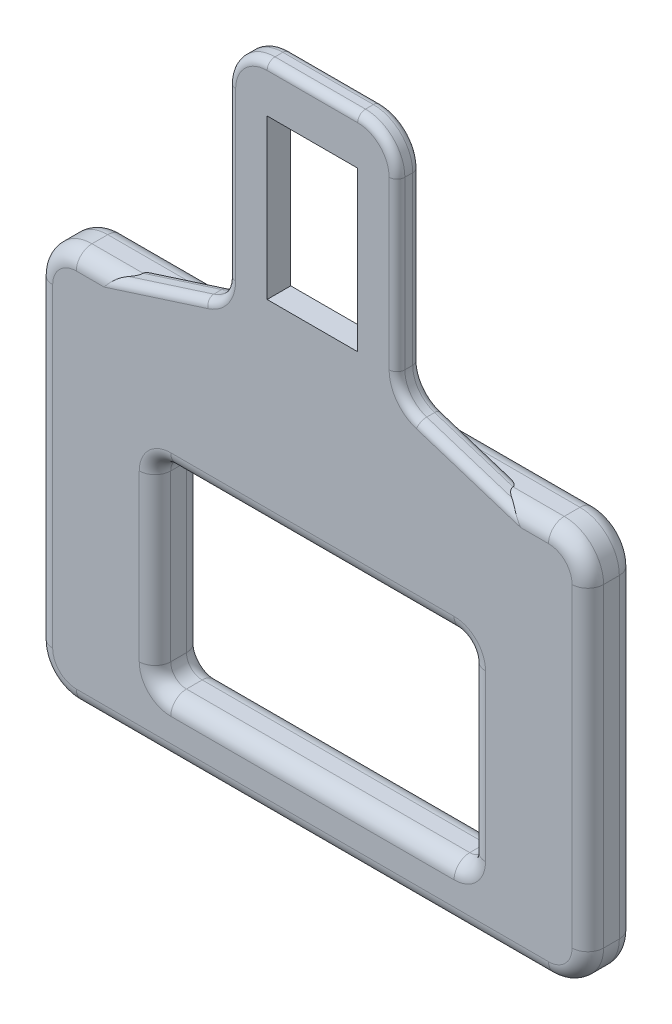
ISO-10303-21;
HEADER;
FILE_DESCRIPTION(('STEP AP214'),'2;1');
FILE_NAME('part.step','',(''),(''),'','','');
FILE_SCHEMA(('AUTOMOTIVE_DESIGN { 1 0 10303 214 1 1 1 1 }'));
ENDSEC;
DATA;
#1=APPLICATION_CONTEXT('core data for automotive mechanical design processes');
#2=APPLICATION_PROTOCOL_DEFINITION('international standard','automotive_design',2000,#1);
#3=PRODUCT_CONTEXT('',#1,'mechanical');
#4=PRODUCT('Part','Part','',(#3));
#5=PRODUCT_RELATED_PRODUCT_CATEGORY('part','',(#4));
#6=PRODUCT_DEFINITION_FORMATION('','',#4);
#7=PRODUCT_DEFINITION_CONTEXT('part definition',#1,'design');
#8=PRODUCT_DEFINITION('design','',#6,#7);
#9=PRODUCT_DEFINITION_SHAPE('','',#8);
#10=(LENGTH_UNIT() NAMED_UNIT(*) SI_UNIT(.MILLI.,.METRE.));
#11=(NAMED_UNIT(*) PLANE_ANGLE_UNIT() SI_UNIT($,.RADIAN.));
#12=(NAMED_UNIT(*) SI_UNIT($,.STERADIAN.) SOLID_ANGLE_UNIT());
#13=UNCERTAINTY_MEASURE_WITH_UNIT(LENGTH_MEASURE(1.E-05),#10,'distance_accuracy_value','');
#14=(GEOMETRIC_REPRESENTATION_CONTEXT(3) GLOBAL_UNCERTAINTY_ASSIGNED_CONTEXT((#13)) GLOBAL_UNIT_ASSIGNED_CONTEXT((#10,
#11,#12)) REPRESENTATION_CONTEXT('',''));
#15=CARTESIAN_POINT('',(0.,0.,0.));
#16=DIRECTION('',(0.,0.,1.));
#17=DIRECTION('',(1.,0.,0.));
#18=AXIS2_PLACEMENT_3D('',#15,#16,#17);
#19=CARTESIAN_POINT('',(30.,-78.1903245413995,-3.));
#20=DIRECTION('',(0.,0.,1.));
#21=DIRECTION('',(1.,0.,0.));
#22=AXIS2_PLACEMENT_3D('',#19,#20,#21);
#23=PLANE('',#22);
#24=DIRECTION('',(-1.,0.,0.));
#25=VECTOR('',#24,1.);
#26=CARTESIAN_POINT('',(30.,-35.1903245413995,-3.));
#27=LINE('',#26,#25);
#28=CARTESIAN_POINT('',(-30.,-35.1903245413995,-3.));
#29=VERTEX_POINT('',#28);
#30=CARTESIAN_POINT('',(30.,-35.1903245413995,-3.));
#31=VERTEX_POINT('',#30);
#32=EDGE_CURVE('E492',#29,#31,#27,.F.);
#33=ORIENTED_EDGE('',*,*,#32,.T.);
#34=CARTESIAN_POINT('',(30.,-38.1903245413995,-3.));
#35=DIRECTION('',(0.,0.,1.));
#36=DIRECTION('',(1.,0.,0.));
#37=AXIS2_PLACEMENT_3D('',#34,#35,#36);
#38=CIRCLE('',#37,3.);
#39=CARTESIAN_POINT('',(33.,-38.1903245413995,-3.));
#40=VERTEX_POINT('',#39);
#41=EDGE_CURVE('E513',#31,#40,#38,.F.);
#42=ORIENTED_EDGE('',*,*,#41,.T.);
#43=DIRECTION('',(0.,1.,0.));
#44=VECTOR('',#43,1.);
#45=CARTESIAN_POINT('',(33.,-78.1903245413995,-3.));
#46=LINE('',#45,#44);
#47=CARTESIAN_POINT('',(33.,-78.1903245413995,-3.));
#48=VERTEX_POINT('',#47);
#49=EDGE_CURVE('E510',#40,#48,#46,.F.);
#50=ORIENTED_EDGE('',*,*,#49,.T.);
#51=CARTESIAN_POINT('',(30.,-78.1903245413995,-3.));
#52=DIRECTION('',(0.,0.,1.));
#53=DIRECTION('',(1.,0.,0.));
#54=AXIS2_PLACEMENT_3D('',#51,#52,#53);
#55=CIRCLE('',#54,3.);
#56=CARTESIAN_POINT('',(30.,-81.1903245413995,-3.));
#57=VERTEX_POINT('',#56);
#58=EDGE_CURVE('E507',#48,#57,#55,.F.);
#59=ORIENTED_EDGE('',*,*,#58,.T.);
#60=DIRECTION('',(1.,0.,0.));
#61=VECTOR('',#60,1.);
#62=CARTESIAN_POINT('',(-30.,-81.1903245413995,-3.));
#63=LINE('',#62,#61);
#64=CARTESIAN_POINT('',(-30.,-81.1903245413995,-3.));
#65=VERTEX_POINT('',#64);
#66=EDGE_CURVE('E504',#57,#65,#63,.F.);
#67=ORIENTED_EDGE('',*,*,#66,.T.);
#68=CARTESIAN_POINT('',(-30.,-78.1903245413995,-3.));
#69=DIRECTION('',(0.,0.,1.));
#70=DIRECTION('',(1.,0.,0.));
#71=AXIS2_PLACEMENT_3D('',#68,#69,#70);
#72=CIRCLE('',#71,3.);
#73=CARTESIAN_POINT('',(-33.,-78.1903245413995,-3.));
#74=VERTEX_POINT('',#73);
#75=EDGE_CURVE('E501',#65,#74,#72,.F.);
#76=ORIENTED_EDGE('',*,*,#75,.T.);
#77=DIRECTION('',(0.,-1.,0.));
#78=VECTOR('',#77,1.);
#79=CARTESIAN_POINT('',(-33.,-38.1903245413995,-3.));
#80=LINE('',#79,#78);
#81=CARTESIAN_POINT('',(-33.,-38.1903245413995,-3.));
#82=VERTEX_POINT('',#81);
#83=EDGE_CURVE('E498',#74,#82,#80,.F.);
#84=ORIENTED_EDGE('',*,*,#83,.T.);
#85=CARTESIAN_POINT('',(-30.,-38.1903245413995,-3.));
#86=DIRECTION('',(0.,0.,1.));
#87=DIRECTION('',(1.,0.,0.));
#88=AXIS2_PLACEMENT_3D('',#85,#86,#87);
#89=CIRCLE('',#88,3.);
#90=EDGE_CURVE('E495',#82,#29,#89,.F.);
#91=ORIENTED_EDGE('',*,*,#90,.T.);
#92=EDGE_LOOP('',(#33,#42,#50,#59,#67,#76,#84,#91));
#93=FACE_BOUND('',#92,.T.);
#94=CARTESIAN_POINT('',(18.,-53.1903245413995,-3.));
#95=DIRECTION('',(0.,0.,1.));
#96=DIRECTION('',(1.,0.,0.));
#97=AXIS2_PLACEMENT_3D('',#94,#95,#96);
#98=CIRCLE('',#97,4.);
#99=CARTESIAN_POINT('',(18.,-49.1903245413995,-3.));
#100=VERTEX_POINT('',#99);
#101=CARTESIAN_POINT('',(22.,-53.1903245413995,-3.));
#102=VERTEX_POINT('',#101);
#103=EDGE_CURVE('E1162',#100,#102,#98,.F.);
#104=ORIENTED_EDGE('',*,*,#103,.F.);
#105=DIRECTION('',(1.,0.,0.));
#106=VECTOR('',#105,1.);
#107=CARTESIAN_POINT('',(30.,-49.1903245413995,-3.));
#108=LINE('',#107,#106);
#109=CARTESIAN_POINT('',(-18.,-49.1903245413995,-3.));
#110=VERTEX_POINT('',#109);
#111=EDGE_CURVE('E1159',#100,#110,#108,.F.);
#112=ORIENTED_EDGE('',*,*,#111,.T.);
#113=CARTESIAN_POINT('',(-18.,-53.1903245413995,-3.));
#114=DIRECTION('',(0.,0.,1.));
#115=DIRECTION('',(1.,0.,0.));
#116=AXIS2_PLACEMENT_3D('',#113,#114,#115);
#117=CIRCLE('',#116,4.);
#118=CARTESIAN_POINT('',(-22.,-53.1903245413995,-3.));
#119=VERTEX_POINT('',#118);
#120=EDGE_CURVE('E1155',#119,#110,#117,.F.);
#121=ORIENTED_EDGE('',*,*,#120,.F.);
#122=DIRECTION('',(0.,1.,0.));
#123=VECTOR('',#122,1.);
#124=CARTESIAN_POINT('',(-22.,-78.1903245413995,-3.));
#125=LINE('',#124,#123);
#126=CARTESIAN_POINT('',(-22.,-74.1903245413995,-3.));
#127=VERTEX_POINT('',#126);
#128=EDGE_CURVE('E1148',#119,#127,#125,.F.);
#129=ORIENTED_EDGE('',*,*,#128,.T.);
#130=CARTESIAN_POINT('',(-18.,-74.1903245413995,-3.));
#131=DIRECTION('',(0.,0.,1.));
#132=DIRECTION('',(1.,0.,0.));
#133=AXIS2_PLACEMENT_3D('',#130,#131,#132);
#134=CIRCLE('',#133,4.);
#135=CARTESIAN_POINT('',(-18.,-78.1903245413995,-3.));
#136=VERTEX_POINT('',#135);
#137=EDGE_CURVE('E1144',#136,#127,#134,.F.);
#138=ORIENTED_EDGE('',*,*,#137,.F.);
#139=DIRECTION('',(-1.,0.,0.));
#140=VECTOR('',#139,1.);
#141=CARTESIAN_POINT('',(30.,-78.1903245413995,-3.));
#142=LINE('',#141,#140);
#143=CARTESIAN_POINT('',(18.,-78.1903245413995,-3.));
#144=VERTEX_POINT('',#143);
#145=EDGE_CURVE('E1141',#136,#144,#142,.F.);
#146=ORIENTED_EDGE('',*,*,#145,.T.);
#147=CARTESIAN_POINT('',(18.,-74.1903245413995,-3.));
#148=DIRECTION('',(0.,0.,1.));
#149=DIRECTION('',(1.,0.,0.));
#150=AXIS2_PLACEMENT_3D('',#147,#148,#149);
#151=CIRCLE('',#150,4.);
#152=CARTESIAN_POINT('',(22.,-74.1903245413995,-3.));
#153=VERTEX_POINT('',#152);
#154=EDGE_CURVE('E1137',#153,#144,#151,.F.);
#155=ORIENTED_EDGE('',*,*,#154,.F.);
#156=DIRECTION('',(0.,-1.,0.));
#157=VECTOR('',#156,1.);
#158=CARTESIAN_POINT('',(22.,-78.1903245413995,-3.));
#159=LINE('',#158,#157);
#160=EDGE_CURVE('E1151',#153,#102,#159,.F.);
#161=ORIENTED_EDGE('',*,*,#160,.T.);
#162=EDGE_LOOP('',(#104,#112,#121,#129,#138,#146,#155,#161));
#163=FACE_BOUND('',#162,.T.);
#164=ADVANCED_FACE('F45',(#93,#163),#23,.F.);
#165=CARTESIAN_POINT('',(14.75,-26.1903245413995,3.));
#166=DIRECTION('',(0.,0.,-1.));
#167=DIRECTION('',(-1.,0.,0.));
#168=AXIS2_PLACEMENT_3D('',#165,#166,#167);
#169=PLANE('',#168);
#170=DIRECTION('',(1.,0.,0.));
#171=VECTOR('',#170,1.);
#172=CARTESIAN_POINT('',(5.75,-26.2,3.));
#173=LINE('',#172,#171);
#174=CARTESIAN_POINT('',(-5.75,-26.2,3.));
#175=VERTEX_POINT('',#174);
#176=CARTESIAN_POINT('',(5.75,-26.2,3.));
#177=VERTEX_POINT('',#176);
#178=EDGE_CURVE('E400',#175,#177,#173,.T.);
#179=ORIENTED_EDGE('',*,*,#178,.F.);
#180=DIRECTION('',(0.,-1.,0.));
#181=VECTOR('',#180,1.);
#182=CARTESIAN_POINT('',(-5.75,-6.,3.));
#183=LINE('',#182,#181);
#184=CARTESIAN_POINT('',(-5.75,-6.,3.));
#185=VERTEX_POINT('',#184);
#186=EDGE_CURVE('E431',#185,#175,#183,.T.);
#187=ORIENTED_EDGE('',*,*,#186,.F.);
#188=DIRECTION('',(-1.,0.,0.));
#189=VECTOR('',#188,1.);
#190=CARTESIAN_POINT('',(5.75,-6.,3.));
#191=LINE('',#190,#189);
#192=CARTESIAN_POINT('',(5.75,-6.,3.));
#193=VERTEX_POINT('',#192);
#194=EDGE_CURVE('E427',#193,#185,#191,.T.);
#195=ORIENTED_EDGE('',*,*,#194,.F.);
#196=DIRECTION('',(0.,1.,0.));
#197=VECTOR('',#196,1.);
#198=CARTESIAN_POINT('',(5.75,-6.,3.));
#199=LINE('',#198,#197);
#200=EDGE_CURVE('E411',#177,#193,#199,.T.);
#201=ORIENTED_EDGE('',*,*,#200,.F.);
#202=EDGE_LOOP('',(#179,#187,#195,#201));
#203=FACE_BOUND('',#202,.T.);
#204=DIRECTION('',(-0.952418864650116,-0.304792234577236,0.));
#205=VECTOR('',#204,1.);
#206=CARTESIAN_POINT('',(13.5334611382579,-22.3888675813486,3.));
#207=LINE('',#206,#205);
#208=CARTESIAN_POINT('',(-13.2260388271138,-30.9524188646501,3.));
#209=VERTEX_POINT('',#208);
#210=CARTESIAN_POINT('',(-26.4687033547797,-35.1903245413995,3.));
#211=VERTEX_POINT('',#210);
#212=EDGE_CURVE('E579',#209,#211,#207,.T.);
#213=ORIENTED_EDGE('',*,*,#212,.T.);
#214=DIRECTION('',(-1.,0.,0.));
#215=VECTOR('',#214,1.);
#216=CARTESIAN_POINT('',(-30.,-35.1903245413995,3.));
#217=LINE('',#216,#215);
#218=CARTESIAN_POINT('',(-30.,-35.1903245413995,3.));
#219=VERTEX_POINT('',#218);
#220=EDGE_CURVE('E775',#211,#219,#217,.T.);
#221=ORIENTED_EDGE('',*,*,#220,.T.);
#222=CARTESIAN_POINT('',(-30.,-38.1903245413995,3.));
#223=DIRECTION('',(0.,0.,-1.));
#224=DIRECTION('',(-1.,0.,0.));
#225=AXIS2_PLACEMENT_3D('',#222,#223,#224);
#226=CIRCLE('',#225,3.);
#227=CARTESIAN_POINT('',(-33.,-38.1903245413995,3.));
#228=VERTEX_POINT('',#227);
#229=EDGE_CURVE('E772',#219,#228,#226,.F.);
#230=ORIENTED_EDGE('',*,*,#229,.T.);
#231=DIRECTION('',(0.,-1.,0.));
#232=VECTOR('',#231,1.);
#233=CARTESIAN_POINT('',(-33.,-78.1903245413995,3.));
#234=LINE('',#233,#232);
#235=CARTESIAN_POINT('',(-33.,-78.1903245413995,3.));
#236=VERTEX_POINT('',#235);
#237=EDGE_CURVE('E688',#228,#236,#234,.T.);
#238=ORIENTED_EDGE('',*,*,#237,.T.);
#239=CARTESIAN_POINT('',(-30.,-78.1903245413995,3.));
#240=DIRECTION('',(0.,0.,-1.));
#241=DIRECTION('',(-1.,0.,0.));
#242=AXIS2_PLACEMENT_3D('',#239,#240,#241);
#243=CIRCLE('',#242,3.);
#244=CARTESIAN_POINT('',(-30.,-81.1903245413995,3.));
#245=VERTEX_POINT('',#244);
#246=EDGE_CURVE('E753',#236,#245,#243,.F.);
#247=ORIENTED_EDGE('',*,*,#246,.T.);
#248=DIRECTION('',(1.,0.,0.));
#249=VECTOR('',#248,1.);
#250=CARTESIAN_POINT('',(30.,-81.1903245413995,3.));
#251=LINE('',#250,#249);
#252=CARTESIAN_POINT('',(30.,-81.1903245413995,3.));
#253=VERTEX_POINT('',#252);
#254=EDGE_CURVE('E756',#245,#253,#251,.T.);
#255=ORIENTED_EDGE('',*,*,#254,.T.);
#256=CARTESIAN_POINT('',(30.,-78.1903245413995,3.));
#257=DIRECTION('',(0.,0.,-1.));
#258=DIRECTION('',(-1.,0.,0.));
#259=AXIS2_PLACEMENT_3D('',#256,#257,#258);
#260=CIRCLE('',#259,3.);
#261=CARTESIAN_POINT('',(33.,-78.1903245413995,3.));
#262=VERTEX_POINT('',#261);
#263=EDGE_CURVE('E759',#253,#262,#260,.F.);
#264=ORIENTED_EDGE('',*,*,#263,.T.);
#265=DIRECTION('',(0.,1.,0.));
#266=VECTOR('',#265,1.);
#267=CARTESIAN_POINT('',(33.,-38.1903245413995,3.));
#268=LINE('',#267,#266);
#269=CARTESIAN_POINT('',(33.,-38.1903245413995,3.));
#270=VERTEX_POINT('',#269);
#271=EDGE_CURVE('E762',#262,#270,#268,.T.);
#272=ORIENTED_EDGE('',*,*,#271,.T.);
#273=CARTESIAN_POINT('',(30.,-38.1903245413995,3.));
#274=DIRECTION('',(0.,0.,-1.));
#275=DIRECTION('',(-1.,0.,0.));
#276=AXIS2_PLACEMENT_3D('',#273,#274,#275);
#277=CIRCLE('',#276,3.);
#278=CARTESIAN_POINT('',(30.,-35.1903245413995,3.));
#279=VERTEX_POINT('',#278);
#280=EDGE_CURVE('E765',#270,#279,#277,.F.);
#281=ORIENTED_EDGE('',*,*,#280,.T.);
#282=DIRECTION('',(-1.,0.,0.));
#283=VECTOR('',#282,1.);
#284=CARTESIAN_POINT('',(20.2190765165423,-35.1903245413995,3.));
#285=LINE('',#284,#283);
#286=CARTESIAN_POINT('',(26.4687033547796,-35.1903245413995,3.));
#287=VERTEX_POINT('',#286);
#288=EDGE_CURVE('E768',#279,#287,#285,.T.);
#289=ORIENTED_EDGE('',*,*,#288,.T.);
#290=DIRECTION('',(-0.952418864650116,0.304792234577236,0.));
#291=VECTOR('',#290,1.);
#292=CARTESIAN_POINT('',(13.2260388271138,-30.9524188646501,3.));
#293=LINE('',#292,#291);
#294=CARTESIAN_POINT('',(13.2260388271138,-30.9524188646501,3.));
#295=VERTEX_POINT('',#294);
#296=EDGE_CURVE('E594',#287,#295,#293,.T.);
#297=ORIENTED_EDGE('',*,*,#296,.T.);
#298=CARTESIAN_POINT('',(14.75,-26.1903245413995,3.));
#299=DIRECTION('',(0.,0.,-1.));
#300=DIRECTION('',(-1.,0.,0.));
#301=AXIS2_PLACEMENT_3D('',#298,#299,#300);
#302=CIRCLE('',#301,5.);
#303=CARTESIAN_POINT('',(9.74999999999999,-26.1903245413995,3.));
#304=VERTEX_POINT('',#303);
#305=EDGE_CURVE('E591',#295,#304,#302,.T.);
#306=ORIENTED_EDGE('',*,*,#305,.T.);
#307=DIRECTION('',(0.,1.,0.));
#308=VECTOR('',#307,1.);
#309=CARTESIAN_POINT('',(9.74999999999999,-26.1903245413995,3.));
#310=LINE('',#309,#308);
#311=CARTESIAN_POINT('',(9.75,-5.00000000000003,3.));
#312=VERTEX_POINT('',#311);
#313=EDGE_CURVE('E588',#304,#312,#310,.T.);
#314=ORIENTED_EDGE('',*,*,#313,.T.);
#315=CARTESIAN_POINT('',(5.75,-5.,3.));
#316=DIRECTION('',(0.,0.,-1.));
#317=DIRECTION('',(-1.,0.,0.));
#318=AXIS2_PLACEMENT_3D('',#315,#316,#317);
#319=CIRCLE('',#318,4.);
#320=CARTESIAN_POINT('',(5.74999999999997,-1.,3.));
#321=VERTEX_POINT('',#320);
#322=EDGE_CURVE('E585',#312,#321,#319,.F.);
#323=ORIENTED_EDGE('',*,*,#322,.T.);
#324=DIRECTION('',(-1.,0.,0.));
#325=VECTOR('',#324,1.);
#326=CARTESIAN_POINT('',(14.75,-1.,3.));
#327=LINE('',#326,#325);
#328=CARTESIAN_POINT('',(-5.74999999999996,-1.,3.));
#329=VERTEX_POINT('',#328);
#330=EDGE_CURVE('E582',#321,#329,#327,.T.);
#331=ORIENTED_EDGE('',*,*,#330,.T.);
#332=CARTESIAN_POINT('',(-5.75,-5.,3.));
#333=DIRECTION('',(0.,0.,-1.));
#334=DIRECTION('',(-1.,0.,0.));
#335=AXIS2_PLACEMENT_3D('',#332,#333,#334);
#336=CIRCLE('',#335,4.);
#337=CARTESIAN_POINT('',(-9.75,-5.00000000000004,3.));
#338=VERTEX_POINT('',#337);
#339=EDGE_CURVE('E538',#329,#338,#336,.F.);
#340=ORIENTED_EDGE('',*,*,#339,.T.);
#341=DIRECTION('',(0.,-1.,0.));
#342=VECTOR('',#341,1.);
#343=CARTESIAN_POINT('',(-9.74999999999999,-26.1903245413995,3.));
#344=LINE('',#343,#342);
#345=CARTESIAN_POINT('',(-9.74999999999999,-26.1903245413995,3.));
#346=VERTEX_POINT('',#345);
#347=EDGE_CURVE('E573',#338,#346,#344,.T.);
#348=ORIENTED_EDGE('',*,*,#347,.T.);
#349=CARTESIAN_POINT('',(-14.75,-26.1903245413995,3.));
#350=DIRECTION('',(0.,0.,-1.));
#351=DIRECTION('',(-1.,0.,0.));
#352=AXIS2_PLACEMENT_3D('',#349,#350,#351);
#353=CIRCLE('',#352,5.);
#354=EDGE_CURVE('E576',#346,#209,#353,.T.);
#355=ORIENTED_EDGE('',*,*,#354,.T.);
#356=EDGE_LOOP('',(#213,#221,#230,#238,#247,#255,#264,#272,#281,#289,#297,#306,#314,#323,#331,
#340,#348,#355));
#357=FACE_BOUND('',#356,.T.);
#358=CARTESIAN_POINT('',(-18.,-53.1903245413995,3.));
#359=DIRECTION('',(0.,0.,-1.));
#360=DIRECTION('',(-1.,0.,0.));
#361=AXIS2_PLACEMENT_3D('',#358,#359,#360);
#362=CIRCLE('',#361,4.);
#363=CARTESIAN_POINT('',(-18.,-49.1903245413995,3.));
#364=VERTEX_POINT('',#363);
#365=CARTESIAN_POINT('',(-22.,-53.1903245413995,3.));
#366=VERTEX_POINT('',#365);
#367=EDGE_CURVE('E1120',#364,#366,#362,.F.);
#368=ORIENTED_EDGE('',*,*,#367,.F.);
#369=DIRECTION('',(1.,0.,0.));
#370=VECTOR('',#369,1.);
#371=CARTESIAN_POINT('',(14.75,-49.1903245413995,3.));
#372=LINE('',#371,#370);
#373=CARTESIAN_POINT('',(18.,-49.1903245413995,3.));
#374=VERTEX_POINT('',#373);
#375=EDGE_CURVE('E1117',#364,#374,#372,.T.);
#376=ORIENTED_EDGE('',*,*,#375,.T.);
#377=CARTESIAN_POINT('',(18.,-53.1903245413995,3.));
#378=DIRECTION('',(0.,0.,-1.));
#379=DIRECTION('',(-1.,0.,0.));
#380=AXIS2_PLACEMENT_3D('',#377,#378,#379);
#381=CIRCLE('',#380,4.);
#382=CARTESIAN_POINT('',(22.,-53.1903245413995,3.));
#383=VERTEX_POINT('',#382);
#384=EDGE_CURVE('E1113',#383,#374,#381,.F.);
#385=ORIENTED_EDGE('',*,*,#384,.F.);
#386=DIRECTION('',(0.,-1.,0.));
#387=VECTOR('',#386,1.);
#388=CARTESIAN_POINT('',(22.,-26.1903245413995,3.));
#389=LINE('',#388,#387);
#390=CARTESIAN_POINT('',(22.,-74.1903245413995,3.));
#391=VERTEX_POINT('',#390);
#392=EDGE_CURVE('E1109',#383,#391,#389,.T.);
#393=ORIENTED_EDGE('',*,*,#392,.T.);
#394=CARTESIAN_POINT('',(18.,-74.1903245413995,3.));
#395=DIRECTION('',(0.,0.,-1.));
#396=DIRECTION('',(-1.,0.,0.));
#397=AXIS2_PLACEMENT_3D('',#394,#395,#396);
#398=CIRCLE('',#397,4.);
#399=CARTESIAN_POINT('',(18.,-78.1903245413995,3.));
#400=VERTEX_POINT('',#399);
#401=EDGE_CURVE('E1105',#400,#391,#398,.F.);
#402=ORIENTED_EDGE('',*,*,#401,.F.);
#403=DIRECTION('',(-1.,0.,0.));
#404=VECTOR('',#403,1.);
#405=CARTESIAN_POINT('',(14.75,-78.1903245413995,3.));
#406=LINE('',#405,#404);
#407=CARTESIAN_POINT('',(-18.,-78.1903245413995,3.));
#408=VERTEX_POINT('',#407);
#409=EDGE_CURVE('E1098',#400,#408,#406,.T.);
#410=ORIENTED_EDGE('',*,*,#409,.T.);
#411=CARTESIAN_POINT('',(-18.,-74.1903245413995,3.));
#412=DIRECTION('',(0.,0.,-1.));
#413=DIRECTION('',(-1.,0.,0.));
#414=AXIS2_PLACEMENT_3D('',#411,#412,#413);
#415=CIRCLE('',#414,4.);
#416=CARTESIAN_POINT('',(-22.,-74.1903245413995,3.));
#417=VERTEX_POINT('',#416);
#418=EDGE_CURVE('E1094',#417,#408,#415,.F.);
#419=ORIENTED_EDGE('',*,*,#418,.F.);
#420=DIRECTION('',(0.,1.,0.));
#421=VECTOR('',#420,1.);
#422=CARTESIAN_POINT('',(-22.,-26.1903245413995,3.));
#423=LINE('',#422,#421);
#424=EDGE_CURVE('E1102',#417,#366,#423,.T.);
#425=ORIENTED_EDGE('',*,*,#424,.T.);
#426=EDGE_LOOP('',(#368,#376,#385,#393,#402,#410,#419,#425));
#427=FACE_BOUND('',#426,.T.);
#428=ADVANCED_FACE('F424',(#203,#357,#427),#169,.F.);
#429=CARTESIAN_POINT('',(14.75,-26.1903245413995,0.));
#430=DIRECTION('',(0.,0.,-1.));
#431=DIRECTION('',(-1.,0.,0.));
#432=AXIS2_PLACEMENT_3D('',#429,#430,#431);
#433=PLANE('',#432);
#434=CARTESIAN_POINT('',(14.75,-26.1903245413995,0.));
#435=DIRECTION('',(0.,0.,-1.));
#436=DIRECTION('',(-1.,0.,0.));
#437=AXIS2_PLACEMENT_3D('',#434,#435,#436);
#438=CIRCLE('',#437,5.);
#439=CARTESIAN_POINT('',(9.74999999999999,-26.1903245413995,0.));
#440=VERTEX_POINT('',#439);
#441=CARTESIAN_POINT('',(13.2260388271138,-30.9524188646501,0.));
#442=VERTEX_POINT('',#441);
#443=EDGE_CURVE('E669',#440,#442,#438,.F.);
#444=ORIENTED_EDGE('',*,*,#443,.T.);
#445=DIRECTION('',(-0.952418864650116,0.304792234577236,0.));
#446=VECTOR('',#445,1.);
#447=CARTESIAN_POINT('',(23.1952077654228,-34.1427434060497,0.));
#448=LINE('',#447,#446);
#449=CARTESIAN_POINT('',(20.2190765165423,-33.1903245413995,0.));
#450=VERTEX_POINT('',#449);
#451=EDGE_CURVE('E672',#442,#450,#448,.F.);
#452=ORIENTED_EDGE('',*,*,#451,.T.);
#453=DIRECTION('',(1.,0.,0.));
#454=VECTOR('',#453,1.);
#455=CARTESIAN_POINT('',(14.75,-33.1903245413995,0.));
#456=LINE('',#455,#454);
#457=CARTESIAN_POINT('',(-20.2190765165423,-33.1903245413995,0.));
#458=VERTEX_POINT('',#457);
#459=EDGE_CURVE('E440',#458,#450,#456,.T.);
#460=ORIENTED_EDGE('',*,*,#459,.F.);
#461=DIRECTION('',(-0.952418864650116,-0.304792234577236,0.));
#462=VECTOR('',#461,1.);
#463=CARTESIAN_POINT('',(-13.2260388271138,-30.9524188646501,0.));
#464=LINE('',#463,#462);
#465=CARTESIAN_POINT('',(-13.2260388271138,-30.9524188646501,0.));
#466=VERTEX_POINT('',#465);
#467=EDGE_CURVE('E657',#458,#466,#464,.F.);
#468=ORIENTED_EDGE('',*,*,#467,.T.);
#469=CARTESIAN_POINT('',(-14.75,-26.1903245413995,0.));
#470=DIRECTION('',(0.,0.,-1.));
#471=DIRECTION('',(-1.,0.,0.));
#472=AXIS2_PLACEMENT_3D('',#469,#470,#471);
#473=CIRCLE('',#472,5.);
#474=CARTESIAN_POINT('',(-9.74999999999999,-26.1903245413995,0.));
#475=VERTEX_POINT('',#474);
#476=EDGE_CURVE('E654',#466,#475,#473,.F.);
#477=ORIENTED_EDGE('',*,*,#476,.T.);
#478=DIRECTION('',(0.,-1.,0.));
#479=VECTOR('',#478,1.);
#480=CARTESIAN_POINT('',(-9.75,-5.00000000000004,0.));
#481=LINE('',#480,#479);
#482=CARTESIAN_POINT('',(-9.75,-5.00000000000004,0.));
#483=VERTEX_POINT('',#482);
#484=EDGE_CURVE('E651',#475,#483,#481,.F.);
#485=ORIENTED_EDGE('',*,*,#484,.T.);
#486=CARTESIAN_POINT('',(-5.75,-5.,0.));
#487=DIRECTION('',(0.,0.,-1.));
#488=DIRECTION('',(-1.,0.,0.));
#489=AXIS2_PLACEMENT_3D('',#486,#487,#488);
#490=CIRCLE('',#489,4.);
#491=CARTESIAN_POINT('',(-5.74999999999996,-1.,0.));
#492=VERTEX_POINT('',#491);
#493=EDGE_CURVE('E648',#483,#492,#490,.T.);
#494=ORIENTED_EDGE('',*,*,#493,.T.);
#495=DIRECTION('',(-1.,0.,0.));
#496=VECTOR('',#495,1.);
#497=CARTESIAN_POINT('',(5.74999999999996,-1.,0.));
#498=LINE('',#497,#496);
#499=CARTESIAN_POINT('',(5.74999999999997,-1.,0.));
#500=VERTEX_POINT('',#499);
#501=EDGE_CURVE('E660',#492,#500,#498,.F.);
#502=ORIENTED_EDGE('',*,*,#501,.T.);
#503=CARTESIAN_POINT('',(5.75,-5.,0.));
#504=DIRECTION('',(0.,0.,-1.));
#505=DIRECTION('',(-1.,0.,0.));
#506=AXIS2_PLACEMENT_3D('',#503,#504,#505);
#507=CIRCLE('',#506,4.);
#508=CARTESIAN_POINT('',(9.75,-5.00000000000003,0.));
#509=VERTEX_POINT('',#508);
#510=EDGE_CURVE('E663',#500,#509,#507,.T.);
#511=ORIENTED_EDGE('',*,*,#510,.T.);
#512=DIRECTION('',(0.,1.,0.));
#513=VECTOR('',#512,1.);
#514=CARTESIAN_POINT('',(9.74999999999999,-26.1903245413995,0.));
#515=LINE('',#514,#513);
#516=EDGE_CURVE('E666',#509,#440,#515,.F.);
#517=ORIENTED_EDGE('',*,*,#516,.T.);
#518=EDGE_LOOP('',(#444,#452,#460,#468,#477,#485,#494,#502,#511,#517));
#519=FACE_BOUND('',#518,.T.);
#520=DIRECTION('',(0.,-1.,0.));
#521=VECTOR('',#520,1.);
#522=CARTESIAN_POINT('',(-5.75,-6.,0.));
#523=LINE('',#522,#521);
#524=CARTESIAN_POINT('',(-5.75,-6.,0.));
#525=VERTEX_POINT('',#524);
#526=CARTESIAN_POINT('',(-5.75,-26.2,0.));
#527=VERTEX_POINT('',#526);
#528=EDGE_CURVE('E412',#525,#527,#523,.T.);
#529=ORIENTED_EDGE('',*,*,#528,.T.);
#530=DIRECTION('',(1.,0.,0.));
#531=VECTOR('',#530,1.);
#532=CARTESIAN_POINT('',(5.75,-26.2,0.));
#533=LINE('',#532,#531);
#534=CARTESIAN_POINT('',(5.75,-26.2,0.));
#535=VERTEX_POINT('',#534);
#536=EDGE_CURVE('E437',#527,#535,#533,.T.);
#537=ORIENTED_EDGE('',*,*,#536,.T.);
#538=DIRECTION('',(0.,1.,0.));
#539=VECTOR('',#538,1.);
#540=CARTESIAN_POINT('',(5.75,-6.,0.));
#541=LINE('',#540,#539);
#542=CARTESIAN_POINT('',(5.75,-6.,0.));
#543=VERTEX_POINT('',#542);
#544=EDGE_CURVE('E418',#535,#543,#541,.T.);
#545=ORIENTED_EDGE('',*,*,#544,.T.);
#546=DIRECTION('',(-1.,0.,0.));
#547=VECTOR('',#546,1.);
#548=CARTESIAN_POINT('',(5.75,-6.,0.));
#549=LINE('',#548,#547);
#550=EDGE_CURVE('E443',#543,#525,#549,.T.);
#551=ORIENTED_EDGE('',*,*,#550,.T.);
#552=EDGE_LOOP('',(#529,#537,#545,#551));
#553=FACE_BOUND('',#552,.T.);
#554=ADVANCED_FACE('F890',(#519,#553),#433,.T.);
#555=CARTESIAN_POINT('',(13.5308310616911,-30.,3.));
#556=DIRECTION('',(-0.304792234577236,-0.952418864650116,0.));
#557=DIRECTION('',(0.952418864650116,-0.304792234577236,0.));
#558=AXIS2_PLACEMENT_3D('',#555,#556,#557);
#559=PLANE('',#558);
#560=DIRECTION('',(0.,0.,-1.));
#561=VECTOR('',#560,1.);
#562=CARTESIAN_POINT('',(13.5308310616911,-30.,3.));
#563=LINE('',#562,#561);
#564=CARTESIAN_POINT('',(13.5308310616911,-30.,2.));
#565=VERTEX_POINT('',#564);
#566=CARTESIAN_POINT('',(13.5308310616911,-30.,1.));
#567=VERTEX_POINT('',#566);
#568=EDGE_CURVE('E484',#565,#567,#563,.T.);
#569=ORIENTED_EDGE('',*,*,#568,.F.);
#570=DIRECTION('',(-0.952418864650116,0.304792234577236,0.));
#571=VECTOR('',#570,1.);
#572=CARTESIAN_POINT('',(13.5308310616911,-30.,2.));
#573=LINE('',#572,#571);
#574=CARTESIAN_POINT('',(24.3372912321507,-33.4582737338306,2.));
#575=VERTEX_POINT('',#574);
#576=EDGE_CURVE('E602',#565,#575,#573,.F.);
#577=ORIENTED_EDGE('',*,*,#576,.T.);
#578=CARTESIAN_POINT('',(29.7496268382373,-35.1903245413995,1.));
#579=DIRECTION('',(-0.304792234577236,-0.952418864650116,0.));
#580=DIRECTION('',(0.952418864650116,-0.304792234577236,0.));
#581=AXIS2_PLACEMENT_3D('',#578,#579,#580);
#582=ELLIPSE('',#581,6.5618469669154,2.);
#583=CARTESIAN_POINT('',(23.5,-33.1903245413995,1.));
#584=VERTEX_POINT('',#583);
#585=EDGE_CURVE('E1099',#575,#584,#582,.T.);
#586=ORIENTED_EDGE('',*,*,#585,.T.);
#587=DIRECTION('',(-0.952418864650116,0.304792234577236,0.));
#588=VECTOR('',#587,1.);
#589=CARTESIAN_POINT('',(13.5308310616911,-30.,1.));
#590=LINE('',#589,#588);
#591=EDGE_CURVE('E598',#584,#567,#590,.T.);
#592=ORIENTED_EDGE('',*,*,#591,.T.);
#593=EDGE_LOOP('',(#569,#577,#586,#592));
#594=FACE_BOUND('',#593,.T.);
#595=ADVANCED_FACE('F945',(#594),#559,.F.);
#596=CARTESIAN_POINT('',(14.75,-26.1903245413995,3.));
#597=DIRECTION('',(0.,0.,-1.));
#598=DIRECTION('',(-1.,0.,0.));
#599=AXIS2_PLACEMENT_3D('',#596,#597,#598);
#600=CYLINDRICAL_SURFACE('',#599,4.);
#601=DIRECTION('',(0.,0.,-1.));
#602=VECTOR('',#601,1.);
#603=CARTESIAN_POINT('',(10.75,-26.1903245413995,3.));
#604=LINE('',#603,#602);
#605=CARTESIAN_POINT('',(10.75,-26.1903245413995,2.));
#606=VERTEX_POINT('',#605);
#607=CARTESIAN_POINT('',(10.75,-26.1903245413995,1.));
#608=VERTEX_POINT('',#607);
#609=EDGE_CURVE('E480',#606,#608,#604,.T.);
#610=ORIENTED_EDGE('',*,*,#609,.F.);
#611=CARTESIAN_POINT('',(14.75,-26.1903245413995,2.));
#612=DIRECTION('',(0.,0.,-1.));
#613=DIRECTION('',(-1.,0.,0.));
#614=AXIS2_PLACEMENT_3D('',#611,#612,#613);
#615=CIRCLE('',#614,4.);
#616=EDGE_CURVE('E608',#606,#565,#615,.F.);
#617=ORIENTED_EDGE('',*,*,#616,.T.);
#618=ORIENTED_EDGE('',*,*,#568,.T.);
#619=CARTESIAN_POINT('',(14.75,-26.1903245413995,1.));
#620=DIRECTION('',(0.,0.,-1.));
#621=DIRECTION('',(-1.,0.,0.));
#622=AXIS2_PLACEMENT_3D('',#619,#620,#621);
#623=CIRCLE('',#622,4.);
#624=EDGE_CURVE('E605',#567,#608,#623,.T.);
#625=ORIENTED_EDGE('',*,*,#624,.T.);
#626=EDGE_LOOP('',(#610,#617,#618,#625));
#627=FACE_BOUND('',#626,.T.);
#628=ADVANCED_FACE('F973',(#627),#600,.F.);
#629=CARTESIAN_POINT('',(10.75,-5.00000000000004,3.));
#630=DIRECTION('',(-1.,0.,0.));
#631=DIRECTION('',(0.,-1.,0.));
#632=AXIS2_PLACEMENT_3D('',#629,#630,#631);
#633=PLANE('',#632);
#634=DIRECTION('',(0.,0.,-1.));
#635=VECTOR('',#634,1.);
#636=CARTESIAN_POINT('',(10.75,-5.00000000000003,3.));
#637=LINE('',#636,#635);
#638=CARTESIAN_POINT('',(10.75,-5.00000000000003,2.));
#639=VERTEX_POINT('',#638);
#640=CARTESIAN_POINT('',(10.75,-5.00000000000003,1.));
#641=VERTEX_POINT('',#640);
#642=EDGE_CURVE('E476',#639,#641,#637,.T.);
#643=ORIENTED_EDGE('',*,*,#642,.F.);
#644=DIRECTION('',(0.,1.,0.));
#645=VECTOR('',#644,1.);
#646=CARTESIAN_POINT('',(10.75,-5.00000000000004,2.));
#647=LINE('',#646,#645);
#648=EDGE_CURVE('E614',#639,#606,#647,.F.);
#649=ORIENTED_EDGE('',*,*,#648,.T.);
#650=ORIENTED_EDGE('',*,*,#609,.T.);
#651=DIRECTION('',(0.,1.,0.));
#652=VECTOR('',#651,1.);
#653=CARTESIAN_POINT('',(10.75,-5.00000000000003,1.));
#654=LINE('',#653,#652);
#655=EDGE_CURVE('E611',#608,#641,#654,.T.);
#656=ORIENTED_EDGE('',*,*,#655,.T.);
#657=EDGE_LOOP('',(#643,#649,#650,#656));
#658=FACE_BOUND('',#657,.T.);
#659=ADVANCED_FACE('F969',(#658),#633,.F.);
#660=CARTESIAN_POINT('',(5.75,-5.,3.));
#661=DIRECTION('',(0.,0.,-1.));
#662=DIRECTION('',(-1.,0.,0.));
#663=AXIS2_PLACEMENT_3D('',#660,#661,#662);
#664=CYLINDRICAL_SURFACE('',#663,5.);
#665=DIRECTION('',(0.,0.,-1.));
#666=VECTOR('',#665,1.);
#667=CARTESIAN_POINT('',(5.74999999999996,0.,3.));
#668=LINE('',#667,#666);
#669=CARTESIAN_POINT('',(5.74999999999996,0.,2.));
#670=VERTEX_POINT('',#669);
#671=CARTESIAN_POINT('',(5.74999999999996,0.,1.));
#672=VERTEX_POINT('',#671);
#673=EDGE_CURVE('E472',#670,#672,#668,.T.);
#674=ORIENTED_EDGE('',*,*,#673,.F.);
#675=CARTESIAN_POINT('',(5.75,-5.,2.));
#676=DIRECTION('',(0.,0.,-1.));
#677=DIRECTION('',(-1.,0.,0.));
#678=AXIS2_PLACEMENT_3D('',#675,#676,#677);
#679=CIRCLE('',#678,5.);
#680=EDGE_CURVE('E620',#670,#639,#679,.T.);
#681=ORIENTED_EDGE('',*,*,#680,.T.);
#682=ORIENTED_EDGE('',*,*,#642,.T.);
#683=CARTESIAN_POINT('',(5.75,-5.,1.));
#684=DIRECTION('',(0.,0.,-1.));
#685=DIRECTION('',(-1.,0.,0.));
#686=AXIS2_PLACEMENT_3D('',#683,#684,#685);
#687=CIRCLE('',#686,5.);
#688=EDGE_CURVE('E617',#641,#672,#687,.F.);
#689=ORIENTED_EDGE('',*,*,#688,.T.);
#690=EDGE_LOOP('',(#674,#681,#682,#689));
#691=FACE_BOUND('',#690,.T.);
#692=ADVANCED_FACE('F965',(#691),#664,.T.);
#693=CARTESIAN_POINT('',(5.74999999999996,0.,3.));
#694=DIRECTION('',(0.,-1.,0.));
#695=DIRECTION('',(0.,0.,-1.));
#696=AXIS2_PLACEMENT_3D('',#693,#694,#695);
#697=PLANE('',#696);
#698=DIRECTION('',(0.,0.,-1.));
#699=VECTOR('',#698,1.);
#700=CARTESIAN_POINT('',(-5.74999999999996,0.,3.));
#701=LINE('',#700,#699);
#702=CARTESIAN_POINT('',(-5.74999999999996,0.,2.));
#703=VERTEX_POINT('',#702);
#704=CARTESIAN_POINT('',(-5.74999999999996,0.,1.));
#705=VERTEX_POINT('',#704);
#706=EDGE_CURVE('E468',#703,#705,#701,.T.);
#707=ORIENTED_EDGE('',*,*,#706,.F.);
#708=DIRECTION('',(-1.,0.,0.));
#709=VECTOR('',#708,1.);
#710=CARTESIAN_POINT('',(5.74999999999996,0.,2.));
#711=LINE('',#710,#709);
#712=EDGE_CURVE('E626',#703,#670,#711,.F.);
#713=ORIENTED_EDGE('',*,*,#712,.T.);
#714=ORIENTED_EDGE('',*,*,#673,.T.);
#715=DIRECTION('',(-1.,0.,0.));
#716=VECTOR('',#715,1.);
#717=CARTESIAN_POINT('',(-5.74999999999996,0.,1.));
#718=LINE('',#717,#716);
#719=EDGE_CURVE('E623',#672,#705,#718,.T.);
#720=ORIENTED_EDGE('',*,*,#719,.T.);
#721=EDGE_LOOP('',(#707,#713,#714,#720));
#722=FACE_BOUND('',#721,.T.);
#723=ADVANCED_FACE('F961',(#722),#697,.F.);
#724=CARTESIAN_POINT('',(-5.75,-5.,3.));
#725=DIRECTION('',(0.,0.,-1.));
#726=DIRECTION('',(-1.,0.,0.));
#727=AXIS2_PLACEMENT_3D('',#724,#725,#726);
#728=CYLINDRICAL_SURFACE('',#727,5.);
#729=DIRECTION('',(0.,0.,-1.));
#730=VECTOR('',#729,1.);
#731=CARTESIAN_POINT('',(-10.75,-5.00000000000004,3.));
#732=LINE('',#731,#730);
#733=CARTESIAN_POINT('',(-10.75,-5.00000000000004,2.));
#734=VERTEX_POINT('',#733);
#735=CARTESIAN_POINT('',(-10.75,-5.00000000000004,1.));
#736=VERTEX_POINT('',#735);
#737=EDGE_CURVE('E464',#734,#736,#732,.T.);
#738=ORIENTED_EDGE('',*,*,#737,.F.);
#739=CARTESIAN_POINT('',(-5.75,-5.,2.));
#740=DIRECTION('',(0.,0.,-1.));
#741=DIRECTION('',(-1.,0.,0.));
#742=AXIS2_PLACEMENT_3D('',#739,#740,#741);
#743=CIRCLE('',#742,5.);
#744=EDGE_CURVE('E678',#734,#703,#743,.T.);
#745=ORIENTED_EDGE('',*,*,#744,.T.);
#746=ORIENTED_EDGE('',*,*,#706,.T.);
#747=CARTESIAN_POINT('',(-5.75,-5.,1.));
#748=DIRECTION('',(0.,0.,-1.));
#749=DIRECTION('',(-1.,0.,0.));
#750=AXIS2_PLACEMENT_3D('',#747,#748,#749);
#751=CIRCLE('',#750,5.);
#752=EDGE_CURVE('E675',#705,#736,#751,.F.);
#753=ORIENTED_EDGE('',*,*,#752,.T.);
#754=EDGE_LOOP('',(#738,#745,#746,#753));
#755=FACE_BOUND('',#754,.T.);
#756=ADVANCED_FACE('F957',(#755),#728,.T.);
#757=CARTESIAN_POINT('',(-10.75,-5.00000000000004,3.));
#758=DIRECTION('',(1.,0.,0.));
#759=DIRECTION('',(0.,1.,0.));
#760=AXIS2_PLACEMENT_3D('',#757,#758,#759);
#761=PLANE('',#760);
#762=DIRECTION('',(0.,0.,-1.));
#763=VECTOR('',#762,1.);
#764=CARTESIAN_POINT('',(-10.75,-26.1903245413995,3.));
#765=LINE('',#764,#763);
#766=CARTESIAN_POINT('',(-10.75,-26.1903245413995,2.));
#767=VERTEX_POINT('',#766);
#768=CARTESIAN_POINT('',(-10.75,-26.1903245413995,1.));
#769=VERTEX_POINT('',#768);
#770=EDGE_CURVE('E460',#767,#769,#765,.T.);
#771=ORIENTED_EDGE('',*,*,#770,.F.);
#772=DIRECTION('',(0.,-1.,0.));
#773=VECTOR('',#772,1.);
#774=CARTESIAN_POINT('',(-10.75,-5.00000000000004,2.));
#775=LINE('',#774,#773);
#776=EDGE_CURVE('E645',#767,#734,#775,.F.);
#777=ORIENTED_EDGE('',*,*,#776,.T.);
#778=ORIENTED_EDGE('',*,*,#737,.T.);
#779=DIRECTION('',(0.,-1.,0.));
#780=VECTOR('',#779,1.);
#781=CARTESIAN_POINT('',(-10.75,-26.1903245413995,1.));
#782=LINE('',#781,#780);
#783=EDGE_CURVE('E642',#736,#769,#782,.T.);
#784=ORIENTED_EDGE('',*,*,#783,.T.);
#785=EDGE_LOOP('',(#771,#777,#778,#784));
#786=FACE_BOUND('',#785,.T.);
#787=ADVANCED_FACE('F953',(#786),#761,.F.);
#788=CARTESIAN_POINT('',(-14.75,-26.1903245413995,3.));
#789=DIRECTION('',(0.,0.,-1.));
#790=DIRECTION('',(-1.,0.,0.));
#791=AXIS2_PLACEMENT_3D('',#788,#789,#790);
#792=CYLINDRICAL_SURFACE('',#791,4.);
#793=DIRECTION('',(0.,0.,-1.));
#794=VECTOR('',#793,1.);
#795=CARTESIAN_POINT('',(-13.5308310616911,-30.,3.));
#796=LINE('',#795,#794);
#797=CARTESIAN_POINT('',(-13.5308310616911,-30.,2.));
#798=VERTEX_POINT('',#797);
#799=CARTESIAN_POINT('',(-13.5308310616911,-30.,1.));
#800=VERTEX_POINT('',#799);
#801=EDGE_CURVE('E420',#798,#800,#796,.T.);
#802=ORIENTED_EDGE('',*,*,#801,.F.);
#803=CARTESIAN_POINT('',(-14.75,-26.1903245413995,2.));
#804=DIRECTION('',(0.,0.,-1.));
#805=DIRECTION('',(-1.,0.,0.));
#806=AXIS2_PLACEMENT_3D('',#803,#804,#805);
#807=CIRCLE('',#806,4.);
#808=EDGE_CURVE('E639',#798,#767,#807,.F.);
#809=ORIENTED_EDGE('',*,*,#808,.T.);
#810=ORIENTED_EDGE('',*,*,#770,.T.);
#811=CARTESIAN_POINT('',(-14.75,-26.1903245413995,1.));
#812=DIRECTION('',(0.,0.,-1.));
#813=DIRECTION('',(-1.,0.,0.));
#814=AXIS2_PLACEMENT_3D('',#811,#812,#813);
#815=CIRCLE('',#814,4.);
#816=EDGE_CURVE('E636',#769,#800,#815,.T.);
#817=ORIENTED_EDGE('',*,*,#816,.T.);
#818=EDGE_LOOP('',(#802,#809,#810,#817));
#819=FACE_BOUND('',#818,.T.);
#820=ADVANCED_FACE('F949',(#819),#792,.F.);
#821=CARTESIAN_POINT('',(-13.5308310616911,-30.,3.));
#822=DIRECTION('',(0.304792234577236,-0.952418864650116,0.));
#823=DIRECTION('',(0.952418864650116,0.304792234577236,0.));
#824=AXIS2_PLACEMENT_3D('',#821,#822,#823);
#825=PLANE('',#824);
#826=DIRECTION('',(-0.952418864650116,-0.304792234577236,0.));
#827=VECTOR('',#826,1.);
#828=CARTESIAN_POINT('',(-23.5,-33.1903245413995,1.));
#829=LINE('',#828,#827);
#830=CARTESIAN_POINT('',(-23.5,-33.1903245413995,1.));
#831=VERTEX_POINT('',#830);
#832=EDGE_CURVE('E629',#800,#831,#829,.T.);
#833=ORIENTED_EDGE('',*,*,#832,.T.);
#834=CARTESIAN_POINT('',(-29.7496268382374,-35.1903245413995,1.));
#835=DIRECTION('',(0.304792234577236,-0.952418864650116,0.));
#836=DIRECTION('',(0.952418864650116,0.304792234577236,0.));
#837=AXIS2_PLACEMENT_3D('',#834,#835,#836);
#838=ELLIPSE('',#837,6.5618469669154,2.);
#839=CARTESIAN_POINT('',(-24.3372912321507,-33.4582737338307,2.));
#840=VERTEX_POINT('',#839);
#841=EDGE_CURVE('E806',#831,#840,#838,.T.);
#842=ORIENTED_EDGE('',*,*,#841,.T.);
#843=DIRECTION('',(-0.952418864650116,-0.304792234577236,0.));
#844=VECTOR('',#843,1.);
#845=CARTESIAN_POINT('',(-13.5308310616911,-30.,2.));
#846=LINE('',#845,#844);
#847=EDGE_CURVE('E633',#840,#798,#846,.F.);
#848=ORIENTED_EDGE('',*,*,#847,.T.);
#849=ORIENTED_EDGE('',*,*,#801,.T.);
#850=EDGE_LOOP('',(#833,#842,#848,#849));
#851=FACE_BOUND('',#850,.T.);
#852=ADVANCED_FACE('F941',(#851),#825,.F.);
#853=CARTESIAN_POINT('',(5.75,-26.2,3.));
#854=DIRECTION('',(0.,1.,0.));
#855=DIRECTION('',(0.,0.,1.));
#856=AXIS2_PLACEMENT_3D('',#853,#854,#855);
#857=PLANE('',#856);
#858=ORIENTED_EDGE('',*,*,#536,.F.);
#859=DIRECTION('',(0.,0.,-1.));
#860=VECTOR('',#859,1.);
#861=CARTESIAN_POINT('',(-5.75,-26.2,3.));
#862=LINE('',#861,#860);
#863=EDGE_CURVE('E406',#175,#527,#862,.T.);
#864=ORIENTED_EDGE('',*,*,#863,.F.);
#865=ORIENTED_EDGE('',*,*,#178,.T.);
#866=DIRECTION('',(0.,0.,-1.));
#867=VECTOR('',#866,1.);
#868=CARTESIAN_POINT('',(5.75,-26.2,3.));
#869=LINE('',#868,#867);
#870=EDGE_CURVE('E403',#177,#535,#869,.T.);
#871=ORIENTED_EDGE('',*,*,#870,.T.);
#872=EDGE_LOOP('',(#858,#864,#865,#871));
#873=FACE_BOUND('',#872,.T.);
#874=ADVANCED_FACE('F402',(#873),#857,.T.);
#875=CARTESIAN_POINT('',(5.75,-6.,3.));
#876=DIRECTION('',(-1.,0.,0.));
#877=DIRECTION('',(0.,0.,1.));
#878=AXIS2_PLACEMENT_3D('',#875,#876,#877);
#879=PLANE('',#878);
#880=ORIENTED_EDGE('',*,*,#544,.F.);
#881=ORIENTED_EDGE('',*,*,#870,.F.);
#882=ORIENTED_EDGE('',*,*,#200,.T.);
#883=DIRECTION('',(0.,0.,-1.));
#884=VECTOR('',#883,1.);
#885=CARTESIAN_POINT('',(5.75,-6.,3.));
#886=LINE('',#885,#884);
#887=EDGE_CURVE('E421',#193,#543,#886,.T.);
#888=ORIENTED_EDGE('',*,*,#887,.T.);
#889=EDGE_LOOP('',(#880,#881,#882,#888));
#890=FACE_BOUND('',#889,.T.);
#891=ADVANCED_FACE('F415',(#890),#879,.T.);
#892=CARTESIAN_POINT('',(5.75,-6.,3.));
#893=DIRECTION('',(0.,-1.,0.));
#894=DIRECTION('',(0.,0.,-1.));
#895=AXIS2_PLACEMENT_3D('',#892,#893,#894);
#896=PLANE('',#895);
#897=ORIENTED_EDGE('',*,*,#550,.F.);
#898=ORIENTED_EDGE('',*,*,#887,.F.);
#899=ORIENTED_EDGE('',*,*,#194,.T.);
#900=DIRECTION('',(0.,0.,-1.));
#901=VECTOR('',#900,1.);
#902=CARTESIAN_POINT('',(-5.75,-6.,3.));
#903=LINE('',#902,#901);
#904=EDGE_CURVE('E452',#185,#525,#903,.T.);
#905=ORIENTED_EDGE('',*,*,#904,.T.);
#906=EDGE_LOOP('',(#897,#898,#899,#905));
#907=FACE_BOUND('',#906,.T.);
#908=ADVANCED_FACE('F933',(#907),#896,.T.);
#909=CARTESIAN_POINT('',(-5.75,-6.,3.));
#910=DIRECTION('',(1.,0.,0.));
#911=DIRECTION('',(0.,0.,-1.));
#912=AXIS2_PLACEMENT_3D('',#909,#910,#911);
#913=PLANE('',#912);
#914=ORIENTED_EDGE('',*,*,#528,.F.);
#915=ORIENTED_EDGE('',*,*,#904,.F.);
#916=ORIENTED_EDGE('',*,*,#186,.T.);
#917=ORIENTED_EDGE('',*,*,#863,.T.);
#918=EDGE_LOOP('',(#914,#915,#916,#917));
#919=FACE_BOUND('',#918,.T.);
#920=ADVANCED_FACE('F918',(#919),#913,.T.);
#921=CARTESIAN_POINT('',(-30.,-33.1903245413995,-3.));
#922=DIRECTION('',(0.,1.,0.));
#923=DIRECTION('',(-1.,0.,0.));
#924=AXIS2_PLACEMENT_3D('',#921,#922,#923);
#925=PLANE('',#924);
#926=DIRECTION('',(0.,0.,1.));
#927=VECTOR('',#926,1.);
#928=CARTESIAN_POINT('',(-30.,-33.1903245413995,-3.));
#929=LINE('',#928,#927);
#930=CARTESIAN_POINT('',(-30.,-33.1903245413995,-1.));
#931=VERTEX_POINT('',#930);
#932=CARTESIAN_POINT('',(-30.,-33.1903245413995,1.));
#933=VERTEX_POINT('',#932);
#934=EDGE_CURVE('E1975',#931,#933,#929,.T.);
#935=ORIENTED_EDGE('',*,*,#934,.T.);
#936=DIRECTION('',(-1.,0.,0.));
#937=VECTOR('',#936,1.);
#938=CARTESIAN_POINT('',(-20.2190765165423,-33.1903245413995,1.));
#939=LINE('',#938,#937);
#940=EDGE_CURVE('E782',#933,#831,#939,.F.);
#941=ORIENTED_EDGE('',*,*,#940,.T.);
#942=CARTESIAN_POINT('',(-20.2190765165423,-33.1903245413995,1.));
#943=DIRECTION('',(0.,1.,0.));
#944=DIRECTION('',(1.,0.,0.));
#945=AXIS2_PLACEMENT_3D('',#942,#943,#944);
#946=ELLIPSE('',#945,3.2809234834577,1.);
#947=EDGE_CURVE('E685',#831,#458,#946,.F.);
#948=ORIENTED_EDGE('',*,*,#947,.T.);
#949=ORIENTED_EDGE('',*,*,#459,.T.);
#950=CARTESIAN_POINT('',(20.2190765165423,-33.1903245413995,1.));
#951=DIRECTION('',(0.,1.,0.));
#952=DIRECTION('',(1.,0.,0.));
#953=AXIS2_PLACEMENT_3D('',#950,#951,#952);
#954=ELLIPSE('',#953,3.2809234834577,1.);
#955=EDGE_CURVE('E681',#450,#584,#954,.F.);
#956=ORIENTED_EDGE('',*,*,#955,.T.);
#957=DIRECTION('',(-1.,0.,0.));
#958=VECTOR('',#957,1.);
#959=CARTESIAN_POINT('',(30.,-33.1903245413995,1.));
#960=LINE('',#959,#958);
#961=CARTESIAN_POINT('',(30.,-33.1903245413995,1.));
#962=VERTEX_POINT('',#961);
#963=EDGE_CURVE('E779',#584,#962,#960,.F.);
#964=ORIENTED_EDGE('',*,*,#963,.T.);
#965=DIRECTION('',(0.,0.,1.));
#966=VECTOR('',#965,1.);
#967=CARTESIAN_POINT('',(30.,-33.1903245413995,-3.));
#968=LINE('',#967,#966);
#969=CARTESIAN_POINT('',(30.,-33.1903245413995,-1.));
#970=VERTEX_POINT('',#969);
#971=EDGE_CURVE('E1967',#970,#962,#968,.T.);
#972=ORIENTED_EDGE('',*,*,#971,.F.);
#973=DIRECTION('',(-1.,0.,0.));
#974=VECTOR('',#973,1.);
#975=CARTESIAN_POINT('',(-30.,-33.1903245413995,-1.));
#976=LINE('',#975,#974);
#977=EDGE_CURVE('E535',#970,#931,#976,.T.);
#978=ORIENTED_EDGE('',*,*,#977,.T.);
#979=EDGE_LOOP('',(#935,#941,#948,#949,#956,#964,#972,#978));
#980=FACE_BOUND('',#979,.T.);
#981=ADVANCED_FACE('F915',(#980),#925,.T.);
#982=CARTESIAN_POINT('',(30.,-78.1903245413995,-3.));
#983=DIRECTION('',(0.,0.,1.));
#984=DIRECTION('',(1.,0.,0.));
#985=AXIS2_PLACEMENT_3D('',#982,#983,#984);
#986=CYLINDRICAL_SURFACE('',#985,5.);
#987=DIRECTION('',(0.,0.,1.));
#988=VECTOR('',#987,1.);
#989=CARTESIAN_POINT('',(35.,-78.1903245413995,-3.));
#990=LINE('',#989,#988);
#991=CARTESIAN_POINT('',(35.,-78.1903245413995,-1.));
#992=VERTEX_POINT('',#991);
#993=CARTESIAN_POINT('',(35.,-78.1903245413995,1.));
#994=VERTEX_POINT('',#993);
#995=EDGE_CURVE('E570',#992,#994,#990,.T.);
#996=ORIENTED_EDGE('',*,*,#995,.T.);
#997=CARTESIAN_POINT('',(30.,-78.1903245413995,1.));
#998=DIRECTION('',(0.,0.,-1.));
#999=DIRECTION('',(-1.,0.,0.));
#1000=AXIS2_PLACEMENT_3D('',#997,#998,#999);
#1001=CIRCLE('',#1000,5.);
#1002=CARTESIAN_POINT('',(30.,-83.1903245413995,1.));
#1003=VERTEX_POINT('',#1002);
#1004=EDGE_CURVE('E794',#994,#1003,#1001,.T.);
#1005=ORIENTED_EDGE('',*,*,#1004,.T.);
#1006=DIRECTION('',(0.,0.,1.));
#1007=VECTOR('',#1006,1.);
#1008=CARTESIAN_POINT('',(30.,-83.1903245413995,-3.));
#1009=LINE('',#1008,#1007);
#1010=CARTESIAN_POINT('',(30.,-83.1903245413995,-1.));
#1011=VERTEX_POINT('',#1010);
#1012=EDGE_CURVE('E1980',#1011,#1003,#1009,.T.);
#1013=ORIENTED_EDGE('',*,*,#1012,.F.);
#1014=CARTESIAN_POINT('',(30.,-78.1903245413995,-1.));
#1015=DIRECTION('',(0.,0.,1.));
#1016=DIRECTION('',(1.,0.,0.));
#1017=AXIS2_PLACEMENT_3D('',#1014,#1015,#1016);
#1018=CIRCLE('',#1017,5.);
#1019=EDGE_CURVE('E520',#1011,#992,#1018,.T.);
#1020=ORIENTED_EDGE('',*,*,#1019,.T.);
#1021=EDGE_LOOP('',(#996,#1005,#1013,#1020));
#1022=FACE_BOUND('',#1021,.T.);
#1023=ADVANCED_FACE('F901',(#1022),#986,.T.);
#1024=CARTESIAN_POINT('',(-30.,-83.1903245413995,-3.));
#1025=DIRECTION('',(0.,-1.,0.));
#1026=DIRECTION('',(0.,0.,-1.));
#1027=AXIS2_PLACEMENT_3D('',#1024,#1025,#1026);
#1028=PLANE('',#1027);
#1029=ORIENTED_EDGE('',*,*,#1012,.T.);
#1030=DIRECTION('',(1.,0.,0.));
#1031=VECTOR('',#1030,1.);
#1032=CARTESIAN_POINT('',(-30.,-83.1903245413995,1.));
#1033=LINE('',#1032,#1031);
#1034=CARTESIAN_POINT('',(-30.,-83.1903245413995,1.));
#1035=VERTEX_POINT('',#1034);
#1036=EDGE_CURVE('E797',#1003,#1035,#1033,.F.);
#1037=ORIENTED_EDGE('',*,*,#1036,.T.);
#1038=DIRECTION('',(0.,0.,1.));
#1039=VECTOR('',#1038,1.);
#1040=CARTESIAN_POINT('',(-30.,-83.1903245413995,-3.));
#1041=LINE('',#1040,#1039);
#1042=CARTESIAN_POINT('',(-30.,-83.1903245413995,-1.));
#1043=VERTEX_POINT('',#1042);
#1044=EDGE_CURVE('E1983',#1043,#1035,#1041,.T.);
#1045=ORIENTED_EDGE('',*,*,#1044,.F.);
#1046=DIRECTION('',(1.,0.,0.));
#1047=VECTOR('',#1046,1.);
#1048=CARTESIAN_POINT('',(30.,-83.1903245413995,-1.));
#1049=LINE('',#1048,#1047);
#1050=EDGE_CURVE('E523',#1043,#1011,#1049,.T.);
#1051=ORIENTED_EDGE('',*,*,#1050,.T.);
#1052=EDGE_LOOP('',(#1029,#1037,#1045,#1051));
#1053=FACE_BOUND('',#1052,.T.);
#1054=ADVANCED_FACE('F897',(#1053),#1028,.T.);
#1055=CARTESIAN_POINT('',(-30.,-78.1903245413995,-3.));
#1056=DIRECTION('',(0.,0.,1.));
#1057=DIRECTION('',(1.,0.,0.));
#1058=AXIS2_PLACEMENT_3D('',#1055,#1056,#1057);
#1059=CYLINDRICAL_SURFACE('',#1058,5.);
#1060=ORIENTED_EDGE('',*,*,#1044,.T.);
#1061=CARTESIAN_POINT('',(-30.,-78.1903245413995,1.));
#1062=DIRECTION('',(0.,0.,-1.));
#1063=DIRECTION('',(-1.,0.,0.));
#1064=AXIS2_PLACEMENT_3D('',#1061,#1062,#1063);
#1065=CIRCLE('',#1064,5.);
#1066=CARTESIAN_POINT('',(-35.,-78.1903245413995,1.));
#1067=VERTEX_POINT('',#1066);
#1068=EDGE_CURVE('E800',#1035,#1067,#1065,.T.);
#1069=ORIENTED_EDGE('',*,*,#1068,.T.);
#1070=DIRECTION('',(0.,0.,1.));
#1071=VECTOR('',#1070,1.);
#1072=CARTESIAN_POINT('',(-35.,-78.1903245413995,-3.));
#1073=LINE('',#1072,#1071);
#1074=CARTESIAN_POINT('',(-35.,-78.1903245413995,-1.));
#1075=VERTEX_POINT('',#1074);
#1076=EDGE_CURVE('E1989',#1075,#1067,#1073,.T.);
#1077=ORIENTED_EDGE('',*,*,#1076,.F.);
#1078=CARTESIAN_POINT('',(-30.,-78.1903245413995,-1.));
#1079=DIRECTION('',(0.,0.,1.));
#1080=DIRECTION('',(1.,0.,0.));
#1081=AXIS2_PLACEMENT_3D('',#1078,#1079,#1080);
#1082=CIRCLE('',#1081,5.);
#1083=EDGE_CURVE('E526',#1075,#1043,#1082,.T.);
#1084=ORIENTED_EDGE('',*,*,#1083,.T.);
#1085=EDGE_LOOP('',(#1060,#1069,#1077,#1084));
#1086=FACE_BOUND('',#1085,.T.);
#1087=ADVANCED_FACE('F900',(#1086),#1059,.T.);
#1088=CARTESIAN_POINT('',(-35.,-38.1903245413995,-3.));
#1089=DIRECTION('',(-1.,0.,0.));
#1090=DIRECTION('',(0.,-1.,0.));
#1091=AXIS2_PLACEMENT_3D('',#1088,#1089,#1090);
#1092=PLANE('',#1091);
#1093=ORIENTED_EDGE('',*,*,#1076,.T.);
#1094=DIRECTION('',(0.,-1.,0.));
#1095=VECTOR('',#1094,1.);
#1096=CARTESIAN_POINT('',(-35.,-38.1903245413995,1.));
#1097=LINE('',#1096,#1095);
#1098=CARTESIAN_POINT('',(-35.,-38.1903245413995,1.));
#1099=VERTEX_POINT('',#1098);
#1100=EDGE_CURVE('E803',#1067,#1099,#1097,.F.);
#1101=ORIENTED_EDGE('',*,*,#1100,.T.);
#1102=DIRECTION('',(0.,0.,1.));
#1103=VECTOR('',#1102,1.);
#1104=CARTESIAN_POINT('',(-35.,-38.1903245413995,-3.));
#1105=LINE('',#1104,#1103);
#1106=CARTESIAN_POINT('',(-35.,-38.1903245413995,-1.));
#1107=VERTEX_POINT('',#1106);
#1108=EDGE_CURVE('E1995',#1107,#1099,#1105,.T.);
#1109=ORIENTED_EDGE('',*,*,#1108,.F.);
#1110=DIRECTION('',(0.,-1.,0.));
#1111=VECTOR('',#1110,1.);
#1112=CARTESIAN_POINT('',(-35.,-78.1903245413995,-1.));
#1113=LINE('',#1112,#1111);
#1114=EDGE_CURVE('E529',#1107,#1075,#1113,.T.);
#1115=ORIENTED_EDGE('',*,*,#1114,.T.);
#1116=EDGE_LOOP('',(#1093,#1101,#1109,#1115));
#1117=FACE_BOUND('',#1116,.T.);
#1118=ADVANCED_FACE('F905',(#1117),#1092,.T.);
#1119=CARTESIAN_POINT('',(-30.,-38.1903245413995,-3.));
#1120=DIRECTION('',(0.,0.,1.));
#1121=DIRECTION('',(1.,0.,0.));
#1122=AXIS2_PLACEMENT_3D('',#1119,#1120,#1121);
#1123=CYLINDRICAL_SURFACE('',#1122,5.);
#1124=ORIENTED_EDGE('',*,*,#1108,.T.);
#1125=CARTESIAN_POINT('',(-30.,-38.1903245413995,1.));
#1126=DIRECTION('',(0.,0.,-1.));
#1127=DIRECTION('',(-1.,0.,0.));
#1128=AXIS2_PLACEMENT_3D('',#1125,#1126,#1127);
#1129=CIRCLE('',#1128,5.);
#1130=EDGE_CURVE('E785',#1099,#933,#1129,.T.);
#1131=ORIENTED_EDGE('',*,*,#1130,.T.);
#1132=ORIENTED_EDGE('',*,*,#934,.F.);
#1133=CARTESIAN_POINT('',(-30.,-38.1903245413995,-1.));
#1134=DIRECTION('',(0.,0.,1.));
#1135=DIRECTION('',(1.,0.,0.));
#1136=AXIS2_PLACEMENT_3D('',#1133,#1134,#1135);
#1137=CIRCLE('',#1136,5.);
#1138=EDGE_CURVE('E532',#931,#1107,#1137,.T.);
#1139=ORIENTED_EDGE('',*,*,#1138,.T.);
#1140=EDGE_LOOP('',(#1124,#1131,#1132,#1139));
#1141=FACE_BOUND('',#1140,.T.);
#1142=ADVANCED_FACE('F909',(#1141),#1123,.T.);
#1143=CARTESIAN_POINT('',(30.,-38.1903245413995,-3.));
#1144=DIRECTION('',(0.,0.,1.));
#1145=DIRECTION('',(1.,0.,0.));
#1146=AXIS2_PLACEMENT_3D('',#1143,#1144,#1145);
#1147=CYLINDRICAL_SURFACE('',#1146,5.);
#1148=ORIENTED_EDGE('',*,*,#971,.T.);
#1149=CARTESIAN_POINT('',(30.,-38.1903245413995,1.));
#1150=DIRECTION('',(0.,0.,-1.));
#1151=DIRECTION('',(-1.,0.,0.));
#1152=AXIS2_PLACEMENT_3D('',#1149,#1150,#1151);
#1153=CIRCLE('',#1152,5.);
#1154=CARTESIAN_POINT('',(35.,-38.1903245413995,1.));
#1155=VERTEX_POINT('',#1154);
#1156=EDGE_CURVE('E788',#962,#1155,#1153,.T.);
#1157=ORIENTED_EDGE('',*,*,#1156,.T.);
#1158=DIRECTION('',(0.,0.,1.));
#1159=VECTOR('',#1158,1.);
#1160=CARTESIAN_POINT('',(35.,-38.1903245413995,-3.));
#1161=LINE('',#1160,#1159);
#1162=CARTESIAN_POINT('',(35.,-38.1903245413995,-1.));
#1163=VERTEX_POINT('',#1162);
#1164=EDGE_CURVE('E1965',#1163,#1155,#1161,.T.);
#1165=ORIENTED_EDGE('',*,*,#1164,.F.);
#1166=CARTESIAN_POINT('',(30.,-38.1903245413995,-1.));
#1167=DIRECTION('',(0.,0.,1.));
#1168=DIRECTION('',(1.,0.,0.));
#1169=AXIS2_PLACEMENT_3D('',#1166,#1167,#1168);
#1170=CIRCLE('',#1169,5.);
#1171=EDGE_CURVE('E488',#1163,#970,#1170,.T.);
#1172=ORIENTED_EDGE('',*,*,#1171,.T.);
#1173=EDGE_LOOP('',(#1148,#1157,#1165,#1172));
#1174=FACE_BOUND('',#1173,.T.);
#1175=ADVANCED_FACE('F913',(#1174),#1147,.T.);
#1176=CARTESIAN_POINT('',(35.,-38.1903245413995,-3.));
#1177=DIRECTION('',(1.,0.,0.));
#1178=DIRECTION('',(0.,1.,0.));
#1179=AXIS2_PLACEMENT_3D('',#1176,#1177,#1178);
#1180=PLANE('',#1179);
#1181=ORIENTED_EDGE('',*,*,#1164,.T.);
#1182=DIRECTION('',(0.,1.,0.));
#1183=VECTOR('',#1182,1.);
#1184=CARTESIAN_POINT('',(35.,-78.1903245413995,1.));
#1185=LINE('',#1184,#1183);
#1186=EDGE_CURVE('E791',#1155,#994,#1185,.F.);
#1187=ORIENTED_EDGE('',*,*,#1186,.T.);
#1188=ORIENTED_EDGE('',*,*,#995,.F.);
#1189=DIRECTION('',(0.,1.,0.));
#1190=VECTOR('',#1189,1.);
#1191=CARTESIAN_POINT('',(35.,-38.1903245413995,-1.));
#1192=LINE('',#1191,#1190);
#1193=EDGE_CURVE('E517',#992,#1163,#1192,.T.);
#1194=ORIENTED_EDGE('',*,*,#1193,.T.);
#1195=EDGE_LOOP('',(#1181,#1187,#1188,#1194));
#1196=FACE_BOUND('',#1195,.T.);
#1197=ADVANCED_FACE('F922',(#1196),#1180,.T.);
#1198=CARTESIAN_POINT('',(-30.,-78.1903245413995,-1.));
#1199=DIRECTION('',(0.,0.,1.));
#1200=DIRECTION('',(1.,0.,0.));
#1201=AXIS2_PLACEMENT_3D('',#1198,#1199,#1200);
#1202=TOROIDAL_SURFACE('',#1201,3.,2.);
#1203=CARTESIAN_POINT('',(-33.,-78.1903245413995,-1.));
#1204=DIRECTION('',(0.,1.,0.));
#1205=DIRECTION('',(0.,0.,1.));
#1206=AXIS2_PLACEMENT_3D('',#1203,#1204,#1205);
#1207=CIRCLE('',#1206,2.);
#1208=EDGE_CURVE('E562',#74,#1075,#1207,.T.);
#1209=ORIENTED_EDGE('',*,*,#1208,.F.);
#1210=ORIENTED_EDGE('',*,*,#75,.F.);
#1211=CARTESIAN_POINT('',(-30.,-81.1903245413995,-1.));
#1212=DIRECTION('',(1.,0.,0.));
#1213=DIRECTION('',(0.,0.,-1.));
#1214=AXIS2_PLACEMENT_3D('',#1211,#1212,#1213);
#1215=CIRCLE('',#1214,2.);
#1216=EDGE_CURVE('E566',#1043,#65,#1215,.T.);
#1217=ORIENTED_EDGE('',*,*,#1216,.F.);
#1218=ORIENTED_EDGE('',*,*,#1083,.F.);
#1219=EDGE_LOOP('',(#1209,#1210,#1217,#1218));
#1220=FACE_BOUND('',#1219,.T.);
#1221=ADVANCED_FACE('F926',(#1220),#1202,.T.);
#1222=CARTESIAN_POINT('',(-30.,-81.1903245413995,-1.));
#1223=DIRECTION('',(-1.,0.,0.));
#1224=DIRECTION('',(0.,0.,1.));
#1225=AXIS2_PLACEMENT_3D('',#1222,#1223,#1224);
#1226=CYLINDRICAL_SURFACE('',#1225,2.);
#1227=ORIENTED_EDGE('',*,*,#1216,.T.);
#1228=ORIENTED_EDGE('',*,*,#66,.F.);
#1229=CARTESIAN_POINT('',(30.,-81.1903245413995,-1.));
#1230=DIRECTION('',(1.,0.,0.));
#1231=DIRECTION('',(0.,0.,-1.));
#1232=AXIS2_PLACEMENT_3D('',#1229,#1230,#1231);
#1233=CIRCLE('',#1232,2.);
#1234=EDGE_CURVE('E558',#1011,#57,#1233,.T.);
#1235=ORIENTED_EDGE('',*,*,#1234,.F.);
#1236=ORIENTED_EDGE('',*,*,#1050,.F.);
#1237=EDGE_LOOP('',(#1227,#1228,#1235,#1236));
#1238=FACE_BOUND('',#1237,.T.);
#1239=ADVANCED_FACE('F1003',(#1238),#1226,.T.);
#1240=CARTESIAN_POINT('',(-33.,-38.1903245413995,-1.));
#1241=DIRECTION('',(0.,1.,0.));
#1242=DIRECTION('',(-1.,0.,0.));
#1243=AXIS2_PLACEMENT_3D('',#1240,#1241,#1242);
#1244=CYLINDRICAL_SURFACE('',#1243,2.);
#1245=ORIENTED_EDGE('',*,*,#1208,.T.);
#1246=ORIENTED_EDGE('',*,*,#1114,.F.);
#1247=CARTESIAN_POINT('',(-33.,-38.1903245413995,-1.));
#1248=DIRECTION('',(0.,1.,0.));
#1249=DIRECTION('',(0.,0.,1.));
#1250=AXIS2_PLACEMENT_3D('',#1247,#1248,#1249);
#1251=CIRCLE('',#1250,2.);
#1252=EDGE_CURVE('E554',#82,#1107,#1251,.T.);
#1253=ORIENTED_EDGE('',*,*,#1252,.F.);
#1254=ORIENTED_EDGE('',*,*,#83,.F.);
#1255=EDGE_LOOP('',(#1245,#1246,#1253,#1254));
#1256=FACE_BOUND('',#1255,.T.);
#1257=ADVANCED_FACE('F999',(#1256),#1244,.T.);
#1258=CARTESIAN_POINT('',(30.,-78.1903245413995,-1.));
#1259=DIRECTION('',(0.,0.,1.));
#1260=DIRECTION('',(1.,0.,0.));
#1261=AXIS2_PLACEMENT_3D('',#1258,#1259,#1260);
#1262=TOROIDAL_SURFACE('',#1261,3.,2.);
#1263=ORIENTED_EDGE('',*,*,#1234,.T.);
#1264=ORIENTED_EDGE('',*,*,#58,.F.);
#1265=CARTESIAN_POINT('',(33.,-78.1903245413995,-1.));
#1266=DIRECTION('',(0.,1.,0.));
#1267=DIRECTION('',(0.,0.,1.));
#1268=AXIS2_PLACEMENT_3D('',#1265,#1266,#1267);
#1269=CIRCLE('',#1268,2.);
#1270=EDGE_CURVE('E550',#992,#48,#1269,.T.);
#1271=ORIENTED_EDGE('',*,*,#1270,.F.);
#1272=ORIENTED_EDGE('',*,*,#1019,.F.);
#1273=EDGE_LOOP('',(#1263,#1264,#1271,#1272));
#1274=FACE_BOUND('',#1273,.T.);
#1275=ADVANCED_FACE('F995',(#1274),#1262,.T.);
#1276=CARTESIAN_POINT('',(-30.,-38.1903245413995,-1.));
#1277=DIRECTION('',(0.,0.,1.));
#1278=DIRECTION('',(1.,0.,0.));
#1279=AXIS2_PLACEMENT_3D('',#1276,#1277,#1278);
#1280=TOROIDAL_SURFACE('',#1279,3.,2.);
#1281=ORIENTED_EDGE('',*,*,#1252,.T.);
#1282=ORIENTED_EDGE('',*,*,#1138,.F.);
#1283=CARTESIAN_POINT('',(-30.,-35.1903245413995,-1.));
#1284=DIRECTION('',(1.,0.,0.));
#1285=DIRECTION('',(0.,0.,-1.));
#1286=AXIS2_PLACEMENT_3D('',#1283,#1284,#1285);
#1287=CIRCLE('',#1286,2.);
#1288=EDGE_CURVE('E546',#29,#931,#1287,.T.);
#1289=ORIENTED_EDGE('',*,*,#1288,.F.);
#1290=ORIENTED_EDGE('',*,*,#90,.F.);
#1291=EDGE_LOOP('',(#1281,#1282,#1289,#1290));
#1292=FACE_BOUND('',#1291,.T.);
#1293=ADVANCED_FACE('F991',(#1292),#1280,.T.);
#1294=CARTESIAN_POINT('',(33.,-38.1903245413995,-1.));
#1295=DIRECTION('',(0.,-1.,0.));
#1296=DIRECTION('',(1.,0.,0.));
#1297=AXIS2_PLACEMENT_3D('',#1294,#1295,#1296);
#1298=CYLINDRICAL_SURFACE('',#1297,2.);
#1299=ORIENTED_EDGE('',*,*,#1270,.T.);
#1300=ORIENTED_EDGE('',*,*,#49,.F.);
#1301=CARTESIAN_POINT('',(33.,-38.1903245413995,-1.));
#1302=DIRECTION('',(0.,1.,0.));
#1303=DIRECTION('',(0.,0.,1.));
#1304=AXIS2_PLACEMENT_3D('',#1301,#1302,#1303);
#1305=CIRCLE('',#1304,2.);
#1306=EDGE_CURVE('E542',#1163,#40,#1305,.T.);
#1307=ORIENTED_EDGE('',*,*,#1306,.F.);
#1308=ORIENTED_EDGE('',*,*,#1193,.F.);
#1309=EDGE_LOOP('',(#1299,#1300,#1307,#1308));
#1310=FACE_BOUND('',#1309,.T.);
#1311=ADVANCED_FACE('F987',(#1310),#1298,.T.);
#1312=CARTESIAN_POINT('',(-30.,-35.1903245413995,-1.));
#1313=DIRECTION('',(1.,0.,0.));
#1314=DIRECTION('',(0.,1.,0.));
#1315=AXIS2_PLACEMENT_3D('',#1312,#1313,#1314);
#1316=CYLINDRICAL_SURFACE('',#1315,2.);
#1317=ORIENTED_EDGE('',*,*,#1288,.T.);
#1318=ORIENTED_EDGE('',*,*,#977,.F.);
#1319=CARTESIAN_POINT('',(30.,-35.1903245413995,-1.));
#1320=DIRECTION('',(1.,0.,0.));
#1321=DIRECTION('',(0.,0.,-1.));
#1322=AXIS2_PLACEMENT_3D('',#1319,#1320,#1321);
#1323=CIRCLE('',#1322,2.);
#1324=EDGE_CURVE('E539',#31,#970,#1323,.T.);
#1325=ORIENTED_EDGE('',*,*,#1324,.F.);
#1326=ORIENTED_EDGE('',*,*,#32,.F.);
#1327=EDGE_LOOP('',(#1317,#1318,#1325,#1326));
#1328=FACE_BOUND('',#1327,.T.);
#1329=ADVANCED_FACE('F983',(#1328),#1316,.T.);
#1330=CARTESIAN_POINT('',(30.,-38.1903245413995,-1.));
#1331=DIRECTION('',(0.,0.,1.));
#1332=DIRECTION('',(1.,0.,0.));
#1333=AXIS2_PLACEMENT_3D('',#1330,#1331,#1332);
#1334=TOROIDAL_SURFACE('',#1333,3.,2.);
#1335=ORIENTED_EDGE('',*,*,#1306,.T.);
#1336=ORIENTED_EDGE('',*,*,#41,.F.);
#1337=ORIENTED_EDGE('',*,*,#1324,.T.);
#1338=ORIENTED_EDGE('',*,*,#1171,.F.);
#1339=EDGE_LOOP('',(#1335,#1336,#1337,#1338));
#1340=FACE_BOUND('',#1339,.T.);
#1341=ADVANCED_FACE('F838',(#1340),#1334,.T.);
#1342=CARTESIAN_POINT('',(13.5334611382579,-22.3888675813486,2.));
#1343=DIRECTION('',(-0.952418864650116,-0.304792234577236,0.));
#1344=DIRECTION('',(0.304792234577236,-0.952418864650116,0.));
#1345=AXIS2_PLACEMENT_3D('',#1342,#1343,#1344);
#1346=CYLINDRICAL_SURFACE('',#1345,1.);
#1347=ORIENTED_EDGE('',*,*,#847,.F.);
#1348=CARTESIAN_POINT('',(-24.3372912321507,-33.4582737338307,2.));
#1349=CARTESIAN_POINT('',(-24.3853091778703,-33.4736385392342,2.02661222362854));
#1350=CARTESIAN_POINT('',(-24.432863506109,-33.4899748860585,2.053490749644));
#1351=CARTESIAN_POINT('',(-24.5270341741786,-33.524699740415,2.1075774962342));
#1352=CARTESIAN_POINT('',(-24.5736503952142,-33.5430885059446,2.134785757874));
#1353=CARTESIAN_POINT('',(-24.7121107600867,-33.6015132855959,2.21662181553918));
#1354=CARTESIAN_POINT('',(-24.8025114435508,-33.6447903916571,2.27142986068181));
#1355=CARTESIAN_POINT('',(-24.9795912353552,-33.7405736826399,2.37965816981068));
#1356=CARTESIAN_POINT('',(-25.066259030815,-33.7931057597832,2.43307404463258));
#1357=CARTESIAN_POINT('',(-25.2356987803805,-33.9072821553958,2.53613461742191));
#1358=CARTESIAN_POINT('',(-25.3184725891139,-33.9689220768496,2.5857811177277));
#1359=CARTESIAN_POINT('',(-25.479562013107,-34.1000246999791,2.67857691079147));
#1360=CARTESIAN_POINT('',(-25.5579177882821,-34.1693898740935,2.72179401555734));
#1361=CARTESIAN_POINT('',(-25.7117028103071,-34.315479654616,2.80042401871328));
#1362=CARTESIAN_POINT('',(-25.7871310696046,-34.3922067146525,2.83583430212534));
#1363=CARTESIAN_POINT('',(-25.9352394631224,-34.551013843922,2.89696618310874));
#1364=CARTESIAN_POINT('',(-26.0079330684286,-34.6330600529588,2.92274312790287));
#1365=CARTESIAN_POINT('',(-26.1517426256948,-34.8010090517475,2.96364161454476));
#1366=CARTESIAN_POINT('',(-26.2228599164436,-34.8869083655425,2.97877256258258));
#1367=CARTESIAN_POINT('',(-26.3205158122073,-35.0067043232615,2.9918316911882));
#1368=CARTESIAN_POINT('',(-26.3473854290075,-35.0398600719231,2.99461030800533));
#1369=CARTESIAN_POINT('',(-26.4010688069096,-35.1063125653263,2.99851137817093));
#1370=CARTESIAN_POINT('',(-26.4278825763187,-35.1396092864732,2.99963409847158));
#1371=CARTESIAN_POINT('',(-26.459361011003,-35.1787169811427,2.99997476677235));
#1372=CARTESIAN_POINT('',(-26.4640322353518,-35.1845208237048,3.0000000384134));
#1373=CARTESIAN_POINT('',(-26.4687033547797,-35.1903245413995,3.));
#1374=B_SPLINE_CURVE_WITH_KNOTS('',3,(#1348,#1349,#1350,#1351,#1352,#1353,#1354,#1355,#1356,
#1357,#1358,#1359,#1360,#1361,#1362,#1363,#1364,#1365,#1366,#1367,#1368,#1369,#1370,#1371,#1372,
#1373),.UNSPECIFIED.,.F.,.F.,(4,2,2,2,2,2,2,2,2,2,2,2,4),(0.,0.171005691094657,
0.342032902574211,0.684283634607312,1.02750752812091,1.37056626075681,1.70970159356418,
2.04895035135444,2.38621888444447,2.72318905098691,2.8514675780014,2.9797254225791,
3.00207583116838),.UNSPECIFIED.);
#1375=EDGE_CURVE('E810',#840,#211,#1374,.T.);
#1376=ORIENTED_EDGE('',*,*,#1375,.T.);
#1377=ORIENTED_EDGE('',*,*,#212,.F.);
#1378=CARTESIAN_POINT('',(-13.2260388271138,-30.9524188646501,2.));
#1379=DIRECTION('',(0.952418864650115,0.304792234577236,0.));
#1380=DIRECTION('',(-0.304792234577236,0.952418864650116,0.));
#1381=AXIS2_PLACEMENT_3D('',#1378,#1379,#1380);
#1382=CIRCLE('',#1381,1.);
#1383=EDGE_CURVE('E543',#798,#209,#1382,.T.);
#1384=ORIENTED_EDGE('',*,*,#1383,.F.);
#1385=EDGE_LOOP('',(#1347,#1376,#1377,#1384));
#1386=FACE_BOUND('',#1385,.T.);
#1387=ADVANCED_FACE('F832',(#1386),#1346,.T.);
#1388=CARTESIAN_POINT('',(-14.75,-26.1903245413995,2.));
#1389=DIRECTION('',(0.,0.,-1.));
#1390=DIRECTION('',(-1.,0.,0.));
#1391=AXIS2_PLACEMENT_3D('',#1388,#1389,#1390);
#1392=TOROIDAL_SURFACE('',#1391,5.,1.);
#1393=ORIENTED_EDGE('',*,*,#1383,.T.);
#1394=ORIENTED_EDGE('',*,*,#354,.F.);
#1395=CARTESIAN_POINT('',(-9.74999999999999,-26.1903245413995,2.));
#1396=DIRECTION('',(0.,1.,0.));
#1397=DIRECTION('',(0.,0.,1.));
#1398=AXIS2_PLACEMENT_3D('',#1395,#1396,#1397);
#1399=CIRCLE('',#1398,1.);
#1400=EDGE_CURVE('E713',#767,#346,#1399,.T.);
#1401=ORIENTED_EDGE('',*,*,#1400,.F.);
#1402=ORIENTED_EDGE('',*,*,#808,.F.);
#1403=EDGE_LOOP('',(#1393,#1394,#1401,#1402));
#1404=FACE_BOUND('',#1403,.T.);
#1405=ADVANCED_FACE('F837',(#1404),#1392,.T.);
#1406=CARTESIAN_POINT('',(-9.74999999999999,-26.1903245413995,2.));
#1407=DIRECTION('',(0.,-1.,0.));
#1408=DIRECTION('',(1.,0.,0.));
#1409=AXIS2_PLACEMENT_3D('',#1406,#1407,#1408);
#1410=CYLINDRICAL_SURFACE('',#1409,1.);
#1411=ORIENTED_EDGE('',*,*,#1400,.T.);
#1412=ORIENTED_EDGE('',*,*,#347,.F.);
#1413=CARTESIAN_POINT('',(-9.75,-5.00000000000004,2.));
#1414=DIRECTION('',(0.,1.,0.));
#1415=DIRECTION('',(0.,0.,1.));
#1416=AXIS2_PLACEMENT_3D('',#1413,#1414,#1415);
#1417=CIRCLE('',#1416,1.);
#1418=EDGE_CURVE('E709',#734,#338,#1417,.T.);
#1419=ORIENTED_EDGE('',*,*,#1418,.F.);
#1420=ORIENTED_EDGE('',*,*,#776,.F.);
#1421=EDGE_LOOP('',(#1411,#1412,#1419,#1420));
#1422=FACE_BOUND('',#1421,.T.);
#1423=ADVANCED_FACE('F1029',(#1422),#1410,.T.);
#1424=CARTESIAN_POINT('',(-5.75,-5.,2.));
#1425=DIRECTION('',(0.,0.,-1.));
#1426=DIRECTION('',(-1.,0.,0.));
#1427=AXIS2_PLACEMENT_3D('',#1424,#1425,#1426);
#1428=TOROIDAL_SURFACE('',#1427,4.,1.);
#1429=ORIENTED_EDGE('',*,*,#1418,.T.);
#1430=ORIENTED_EDGE('',*,*,#339,.F.);
#1431=CARTESIAN_POINT('',(-5.74999999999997,-1.,2.));
#1432=DIRECTION('',(1.,0.,0.));
#1433=DIRECTION('',(0.,0.,-1.));
#1434=AXIS2_PLACEMENT_3D('',#1431,#1432,#1433);
#1435=CIRCLE('',#1434,1.);
#1436=EDGE_CURVE('E705',#703,#329,#1435,.T.);
#1437=ORIENTED_EDGE('',*,*,#1436,.F.);
#1438=ORIENTED_EDGE('',*,*,#744,.F.);
#1439=EDGE_LOOP('',(#1429,#1430,#1437,#1438));
#1440=FACE_BOUND('',#1439,.T.);
#1441=ADVANCED_FACE('F1026',(#1440),#1428,.T.);
#1442=CARTESIAN_POINT('',(14.75,-1.,2.));
#1443=DIRECTION('',(-1.,0.,0.));
#1444=DIRECTION('',(0.,0.,1.));
#1445=AXIS2_PLACEMENT_3D('',#1442,#1443,#1444);
#1446=CYLINDRICAL_SURFACE('',#1445,1.);
#1447=ORIENTED_EDGE('',*,*,#1436,.T.);
#1448=ORIENTED_EDGE('',*,*,#330,.F.);
#1449=CARTESIAN_POINT('',(5.74999999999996,-1.,2.));
#1450=DIRECTION('',(1.,0.,0.));
#1451=DIRECTION('',(0.,0.,-1.));
#1452=AXIS2_PLACEMENT_3D('',#1449,#1450,#1451);
#1453=CIRCLE('',#1452,1.);
#1454=EDGE_CURVE('E701',#670,#321,#1453,.T.);
#1455=ORIENTED_EDGE('',*,*,#1454,.F.);
#1456=ORIENTED_EDGE('',*,*,#712,.F.);
#1457=EDGE_LOOP('',(#1447,#1448,#1455,#1456));
#1458=FACE_BOUND('',#1457,.T.);
#1459=ADVANCED_FACE('F1022',(#1458),#1446,.T.);
#1460=CARTESIAN_POINT('',(5.75,-5.,2.));
#1461=DIRECTION('',(0.,0.,-1.));
#1462=DIRECTION('',(-1.,0.,0.));
#1463=AXIS2_PLACEMENT_3D('',#1460,#1461,#1462);
#1464=TOROIDAL_SURFACE('',#1463,4.,1.);
#1465=ORIENTED_EDGE('',*,*,#1454,.T.);
#1466=ORIENTED_EDGE('',*,*,#322,.F.);
#1467=CARTESIAN_POINT('',(9.75,-5.00000000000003,2.));
#1468=DIRECTION('',(0.,-1.,0.));
#1469=DIRECTION('',(0.,0.,-1.));
#1470=AXIS2_PLACEMENT_3D('',#1467,#1468,#1469);
#1471=CIRCLE('',#1470,1.);
#1472=EDGE_CURVE('E697',#639,#312,#1471,.T.);
#1473=ORIENTED_EDGE('',*,*,#1472,.F.);
#1474=ORIENTED_EDGE('',*,*,#680,.F.);
#1475=EDGE_LOOP('',(#1465,#1466,#1473,#1474));
#1476=FACE_BOUND('',#1475,.T.);
#1477=ADVANCED_FACE('F1018',(#1476),#1464,.T.);
#1478=CARTESIAN_POINT('',(9.74999999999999,-26.1903245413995,2.));
#1479=DIRECTION('',(0.,1.,0.));
#1480=DIRECTION('',(-1.,0.,0.));
#1481=AXIS2_PLACEMENT_3D('',#1478,#1479,#1480);
#1482=CYLINDRICAL_SURFACE('',#1481,1.);
#1483=ORIENTED_EDGE('',*,*,#1472,.T.);
#1484=ORIENTED_EDGE('',*,*,#313,.F.);
#1485=CARTESIAN_POINT('',(9.74999999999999,-26.1903245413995,2.));
#1486=DIRECTION('',(0.,-1.,0.));
#1487=DIRECTION('',(0.,0.,-1.));
#1488=AXIS2_PLACEMENT_3D('',#1485,#1486,#1487);
#1489=CIRCLE('',#1488,1.);
#1490=EDGE_CURVE('E692',#606,#304,#1489,.T.);
#1491=ORIENTED_EDGE('',*,*,#1490,.F.);
#1492=ORIENTED_EDGE('',*,*,#648,.F.);
#1493=EDGE_LOOP('',(#1483,#1484,#1491,#1492));
#1494=FACE_BOUND('',#1493,.T.);
#1495=ADVANCED_FACE('F1014',(#1494),#1482,.T.);
#1496=CARTESIAN_POINT('',(14.75,-26.1903245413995,2.));
#1497=DIRECTION('',(0.,0.,-1.));
#1498=DIRECTION('',(-1.,0.,0.));
#1499=AXIS2_PLACEMENT_3D('',#1496,#1497,#1498);
#1500=TOROIDAL_SURFACE('',#1499,5.,1.);
#1501=ORIENTED_EDGE('',*,*,#1490,.T.);
#1502=ORIENTED_EDGE('',*,*,#305,.F.);
#1503=CARTESIAN_POINT('',(13.2260388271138,-30.9524188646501,2.));
#1504=DIRECTION('',(0.952418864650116,-0.304792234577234,0.));
#1505=DIRECTION('',(0.304792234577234,0.952418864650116,0.));
#1506=AXIS2_PLACEMENT_3D('',#1503,#1504,#1505);
#1507=CIRCLE('',#1506,1.);
#1508=EDGE_CURVE('E689',#565,#295,#1507,.T.);
#1509=ORIENTED_EDGE('',*,*,#1508,.F.);
#1510=ORIENTED_EDGE('',*,*,#616,.F.);
#1511=EDGE_LOOP('',(#1501,#1502,#1509,#1510));
#1512=FACE_BOUND('',#1511,.T.);
#1513=ADVANCED_FACE('F880',(#1512),#1500,.T.);
#1514=CARTESIAN_POINT('',(13.2260388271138,-30.9524188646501,2.));
#1515=DIRECTION('',(-0.952418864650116,0.304792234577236,0.));
#1516=DIRECTION('',(-0.304792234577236,-0.952418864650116,0.));
#1517=AXIS2_PLACEMENT_3D('',#1514,#1515,#1516);
#1518=CYLINDRICAL_SURFACE('',#1517,1.);
#1519=ORIENTED_EDGE('',*,*,#296,.F.);
#1520=CARTESIAN_POINT('',(24.3372912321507,-33.4582737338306,2.));
#1521=CARTESIAN_POINT('',(24.3853091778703,-33.4736385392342,2.02661222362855));
#1522=CARTESIAN_POINT('',(24.432863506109,-33.4899748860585,2.05349074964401));
#1523=CARTESIAN_POINT('',(24.5270341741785,-33.524699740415,2.10757749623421));
#1524=CARTESIAN_POINT('',(24.5736503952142,-33.5430885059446,2.13478575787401));
#1525=CARTESIAN_POINT('',(24.7121107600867,-33.6015132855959,2.2166218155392));
#1526=CARTESIAN_POINT('',(24.8025114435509,-33.6447903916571,2.27142986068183));
#1527=CARTESIAN_POINT('',(24.9795912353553,-33.74057368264,2.3796581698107));
#1528=CARTESIAN_POINT('',(25.066259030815,-33.7931057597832,2.4330740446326));
#1529=CARTESIAN_POINT('',(25.2356987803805,-33.9072821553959,2.53613461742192));
#1530=CARTESIAN_POINT('',(25.3184725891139,-33.9689220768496,2.58578111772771));
#1531=CARTESIAN_POINT('',(25.479562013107,-34.1000246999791,2.67857691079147));
#1532=CARTESIAN_POINT('',(25.5579177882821,-34.1693898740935,2.72179401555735));
#1533=CARTESIAN_POINT('',(25.711702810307,-34.315479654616,2.80042401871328));
#1534=CARTESIAN_POINT('',(25.7871310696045,-34.3922067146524,2.83583430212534));
#1535=CARTESIAN_POINT('',(25.9352394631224,-34.551013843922,2.89696618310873));
#1536=CARTESIAN_POINT('',(26.0079330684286,-34.6330600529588,2.92274312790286));
#1537=CARTESIAN_POINT('',(26.1517426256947,-34.8010090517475,2.96364161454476));
#1538=CARTESIAN_POINT('',(26.2228599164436,-34.8869083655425,2.97877256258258));
#1539=CARTESIAN_POINT('',(26.3205158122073,-35.0067043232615,2.9918316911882));
#1540=CARTESIAN_POINT('',(26.3473854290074,-35.0398600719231,2.99461030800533));
#1541=CARTESIAN_POINT('',(26.4010688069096,-35.1063125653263,2.99851137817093));
#1542=CARTESIAN_POINT('',(26.4278825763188,-35.1396092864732,2.99963409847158));
#1543=CARTESIAN_POINT('',(26.459361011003,-35.1787169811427,2.99997476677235));
#1544=CARTESIAN_POINT('',(26.4640322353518,-35.1845208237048,3.0000000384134));
#1545=CARTESIAN_POINT('',(26.4687033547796,-35.1903245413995,3.));
#1546=B_SPLINE_CURVE_WITH_KNOTS('',3,(#1520,#1521,#1522,#1523,#1524,#1525,#1526,#1527,#1528,
#1529,#1530,#1531,#1532,#1533,#1534,#1535,#1536,#1537,#1538,#1539,#1540,#1541,#1542,#1543,#1544,
#1545),.UNSPECIFIED.,.F.,.F.,(4,2,2,2,2,2,2,2,2,2,2,2,4),(0.,0.171005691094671,
0.342032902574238,0.684283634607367,1.02750752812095,1.37056626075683,1.70970159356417,
2.04895035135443,2.38621888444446,2.72318905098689,2.85146757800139,2.9797254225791,
3.00207583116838),.UNSPECIFIED.);
#1547=EDGE_CURVE('E820',#287,#575,#1546,.F.);
#1548=ORIENTED_EDGE('',*,*,#1547,.T.);
#1549=ORIENTED_EDGE('',*,*,#576,.F.);
#1550=ORIENTED_EDGE('',*,*,#1508,.T.);
#1551=EDGE_LOOP('',(#1519,#1548,#1549,#1550));
#1552=FACE_BOUND('',#1551,.T.);
#1553=ADVANCED_FACE('F875',(#1552),#1518,.T.);
#1554=CARTESIAN_POINT('',(-13.2260388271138,-30.9524188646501,1.));
#1555=DIRECTION('',(0.952418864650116,0.304792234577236,0.));
#1556=DIRECTION('',(-0.304792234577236,0.952418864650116,0.));
#1557=AXIS2_PLACEMENT_3D('',#1554,#1555,#1556);
#1558=CYLINDRICAL_SURFACE('',#1557,1.);
#1559=ORIENTED_EDGE('',*,*,#947,.F.);
#1560=ORIENTED_EDGE('',*,*,#832,.F.);
#1561=CARTESIAN_POINT('',(-13.2260388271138,-30.9524188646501,1.));
#1562=DIRECTION('',(0.952418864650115,0.304792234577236,0.));
#1563=DIRECTION('',(-0.304792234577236,0.952418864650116,0.));
#1564=AXIS2_PLACEMENT_3D('',#1561,#1562,#1563);
#1565=CIRCLE('',#1564,1.);
#1566=EDGE_CURVE('E693',#466,#800,#1565,.T.);
#1567=ORIENTED_EDGE('',*,*,#1566,.F.);
#1568=ORIENTED_EDGE('',*,*,#467,.F.);
#1569=EDGE_LOOP('',(#1559,#1560,#1567,#1568));
#1570=FACE_BOUND('',#1569,.T.);
#1571=ADVANCED_FACE('F872',(#1570),#1558,.T.);
#1572=CARTESIAN_POINT('',(-14.75,-26.1903245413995,1.));
#1573=DIRECTION('',(0.,0.,-1.));
#1574=DIRECTION('',(-1.,0.,0.));
#1575=AXIS2_PLACEMENT_3D('',#1572,#1573,#1574);
#1576=TOROIDAL_SURFACE('',#1575,5.,1.);
#1577=ORIENTED_EDGE('',*,*,#1566,.T.);
#1578=ORIENTED_EDGE('',*,*,#816,.F.);
#1579=CARTESIAN_POINT('',(-9.74999999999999,-26.1903245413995,1.));
#1580=DIRECTION('',(0.,1.,0.));
#1581=DIRECTION('',(0.,0.,1.));
#1582=AXIS2_PLACEMENT_3D('',#1579,#1580,#1581);
#1583=CIRCLE('',#1582,1.);
#1584=EDGE_CURVE('E744',#475,#769,#1583,.T.);
#1585=ORIENTED_EDGE('',*,*,#1584,.F.);
#1586=ORIENTED_EDGE('',*,*,#476,.F.);
#1587=EDGE_LOOP('',(#1577,#1578,#1585,#1586));
#1588=FACE_BOUND('',#1587,.T.);
#1589=ADVANCED_FACE('F869',(#1588),#1576,.T.);
#1590=CARTESIAN_POINT('',(-9.75,-5.00000000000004,1.));
#1591=DIRECTION('',(0.,1.,0.));
#1592=DIRECTION('',(-1.,0.,0.));
#1593=AXIS2_PLACEMENT_3D('',#1590,#1591,#1592);
#1594=CYLINDRICAL_SURFACE('',#1593,1.);
#1595=ORIENTED_EDGE('',*,*,#1584,.T.);
#1596=ORIENTED_EDGE('',*,*,#783,.F.);
#1597=CARTESIAN_POINT('',(-9.75,-5.00000000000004,1.));
#1598=DIRECTION('',(0.,1.,0.));
#1599=DIRECTION('',(0.,0.,1.));
#1600=AXIS2_PLACEMENT_3D('',#1597,#1598,#1599);
#1601=CIRCLE('',#1600,1.);
#1602=EDGE_CURVE('E740',#483,#736,#1601,.T.);
#1603=ORIENTED_EDGE('',*,*,#1602,.F.);
#1604=ORIENTED_EDGE('',*,*,#484,.F.);
#1605=EDGE_LOOP('',(#1595,#1596,#1603,#1604));
#1606=FACE_BOUND('',#1605,.T.);
#1607=ADVANCED_FACE('F865',(#1606),#1594,.T.);
#1608=CARTESIAN_POINT('',(-5.75,-5.,1.));
#1609=DIRECTION('',(0.,0.,-1.));
#1610=DIRECTION('',(-1.,0.,0.));
#1611=AXIS2_PLACEMENT_3D('',#1608,#1609,#1610);
#1612=TOROIDAL_SURFACE('',#1611,4.,1.);
#1613=ORIENTED_EDGE('',*,*,#1602,.T.);
#1614=ORIENTED_EDGE('',*,*,#752,.F.);
#1615=CARTESIAN_POINT('',(-5.74999999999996,-1.,1.));
#1616=DIRECTION('',(1.,0.,0.));
#1617=DIRECTION('',(0.,0.,-1.));
#1618=AXIS2_PLACEMENT_3D('',#1615,#1616,#1617);
#1619=CIRCLE('',#1618,1.);
#1620=EDGE_CURVE('E736',#492,#705,#1619,.T.);
#1621=ORIENTED_EDGE('',*,*,#1620,.F.);
#1622=ORIENTED_EDGE('',*,*,#493,.F.);
#1623=EDGE_LOOP('',(#1613,#1614,#1621,#1622));
#1624=FACE_BOUND('',#1623,.T.);
#1625=ADVANCED_FACE('F861',(#1624),#1612,.T.);
#1626=CARTESIAN_POINT('',(5.74999999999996,-1.,1.));
#1627=DIRECTION('',(1.,0.,0.));
#1628=DIRECTION('',(0.,0.,-1.));
#1629=AXIS2_PLACEMENT_3D('',#1626,#1627,#1628);
#1630=CYLINDRICAL_SURFACE('',#1629,1.);
#1631=ORIENTED_EDGE('',*,*,#1620,.T.);
#1632=ORIENTED_EDGE('',*,*,#719,.F.);
#1633=CARTESIAN_POINT('',(5.74999999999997,-1.,1.));
#1634=DIRECTION('',(1.,0.,0.));
#1635=DIRECTION('',(0.,1.,0.));
#1636=AXIS2_PLACEMENT_3D('',#1633,#1634,#1635);
#1637=CIRCLE('',#1636,1.);
#1638=EDGE_CURVE('E732',#500,#672,#1637,.T.);
#1639=ORIENTED_EDGE('',*,*,#1638,.F.);
#1640=ORIENTED_EDGE('',*,*,#501,.F.);
#1641=EDGE_LOOP('',(#1631,#1632,#1639,#1640));
#1642=FACE_BOUND('',#1641,.T.);
#1643=ADVANCED_FACE('F857',(#1642),#1630,.T.);
#1644=CARTESIAN_POINT('',(5.75,-5.,1.));
#1645=DIRECTION('',(0.,0.,-1.));
#1646=DIRECTION('',(-1.,0.,0.));
#1647=AXIS2_PLACEMENT_3D('',#1644,#1645,#1646);
#1648=TOROIDAL_SURFACE('',#1647,4.,1.);
#1649=ORIENTED_EDGE('',*,*,#1638,.T.);
#1650=ORIENTED_EDGE('',*,*,#688,.F.);
#1651=CARTESIAN_POINT('',(9.75,-5.00000000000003,1.));
#1652=DIRECTION('',(0.,-1.,0.));
#1653=DIRECTION('',(0.,0.,-1.));
#1654=AXIS2_PLACEMENT_3D('',#1651,#1652,#1653);
#1655=CIRCLE('',#1654,1.);
#1656=EDGE_CURVE('E728',#509,#641,#1655,.T.);
#1657=ORIENTED_EDGE('',*,*,#1656,.F.);
#1658=ORIENTED_EDGE('',*,*,#510,.F.);
#1659=EDGE_LOOP('',(#1649,#1650,#1657,#1658));
#1660=FACE_BOUND('',#1659,.T.);
#1661=ADVANCED_FACE('F853',(#1660),#1648,.T.);
#1662=CARTESIAN_POINT('',(9.75,-5.00000000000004,1.));
#1663=DIRECTION('',(0.,-1.,0.));
#1664=DIRECTION('',(1.,0.,0.));
#1665=AXIS2_PLACEMENT_3D('',#1662,#1663,#1664);
#1666=CYLINDRICAL_SURFACE('',#1665,1.);
#1667=ORIENTED_EDGE('',*,*,#1656,.T.);
#1668=ORIENTED_EDGE('',*,*,#655,.F.);
#1669=CARTESIAN_POINT('',(9.74999999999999,-26.1903245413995,1.));
#1670=DIRECTION('',(0.,-1.,0.));
#1671=DIRECTION('',(0.,0.,-1.));
#1672=AXIS2_PLACEMENT_3D('',#1669,#1670,#1671);
#1673=CIRCLE('',#1672,1.);
#1674=EDGE_CURVE('E723',#440,#608,#1673,.T.);
#1675=ORIENTED_EDGE('',*,*,#1674,.F.);
#1676=ORIENTED_EDGE('',*,*,#516,.F.);
#1677=EDGE_LOOP('',(#1667,#1668,#1675,#1676));
#1678=FACE_BOUND('',#1677,.T.);
#1679=ADVANCED_FACE('F849',(#1678),#1666,.T.);
#1680=CARTESIAN_POINT('',(14.75,-26.1903245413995,1.));
#1681=DIRECTION('',(0.,0.,-1.));
#1682=DIRECTION('',(-1.,0.,0.));
#1683=AXIS2_PLACEMENT_3D('',#1680,#1681,#1682);
#1684=TOROIDAL_SURFACE('',#1683,5.,1.);
#1685=ORIENTED_EDGE('',*,*,#1674,.T.);
#1686=ORIENTED_EDGE('',*,*,#624,.F.);
#1687=CARTESIAN_POINT('',(13.2260388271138,-30.9524188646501,1.));
#1688=DIRECTION('',(0.952418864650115,-0.304792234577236,0.));
#1689=DIRECTION('',(0.304792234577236,0.952418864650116,0.));
#1690=AXIS2_PLACEMENT_3D('',#1687,#1688,#1689);
#1691=CIRCLE('',#1690,1.);
#1692=EDGE_CURVE('E720',#442,#567,#1691,.T.);
#1693=ORIENTED_EDGE('',*,*,#1692,.F.);
#1694=ORIENTED_EDGE('',*,*,#443,.F.);
#1695=EDGE_LOOP('',(#1685,#1686,#1693,#1694));
#1696=FACE_BOUND('',#1695,.T.);
#1697=ADVANCED_FACE('F845',(#1696),#1684,.T.);
#1698=CARTESIAN_POINT('',(13.2260388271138,-30.9524188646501,1.));
#1699=DIRECTION('',(0.952418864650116,-0.304792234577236,0.));
#1700=DIRECTION('',(0.304792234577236,0.952418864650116,0.));
#1701=AXIS2_PLACEMENT_3D('',#1698,#1699,#1700);
#1702=CYLINDRICAL_SURFACE('',#1701,1.);
#1703=ORIENTED_EDGE('',*,*,#955,.F.);
#1704=ORIENTED_EDGE('',*,*,#451,.F.);
#1705=ORIENTED_EDGE('',*,*,#1692,.T.);
#1706=ORIENTED_EDGE('',*,*,#591,.F.);
#1707=EDGE_LOOP('',(#1703,#1704,#1705,#1706));
#1708=FACE_BOUND('',#1707,.T.);
#1709=ADVANCED_FACE('F841',(#1708),#1702,.T.);
#1710=CARTESIAN_POINT('',(14.75,-35.1903245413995,1.));
#1711=DIRECTION('',(1.,0.,0.));
#1712=DIRECTION('',(0.,1.,0.));
#1713=AXIS2_PLACEMENT_3D('',#1710,#1711,#1712);
#1714=CYLINDRICAL_SURFACE('',#1713,2.);
#1715=ORIENTED_EDGE('',*,*,#1547,.F.);
#1716=ORIENTED_EDGE('',*,*,#288,.F.);
#1717=CARTESIAN_POINT('',(30.,-35.1903245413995,1.));
#1718=DIRECTION('',(1.,0.,0.));
#1719=DIRECTION('',(0.,0.,-1.));
#1720=AXIS2_PLACEMENT_3D('',#1717,#1718,#1719);
#1721=CIRCLE('',#1720,2.);
#1722=EDGE_CURVE('E724',#962,#279,#1721,.T.);
#1723=ORIENTED_EDGE('',*,*,#1722,.F.);
#1724=ORIENTED_EDGE('',*,*,#963,.F.);
#1725=ORIENTED_EDGE('',*,*,#585,.F.);
#1726=EDGE_LOOP('',(#1715,#1716,#1723,#1724,#1725));
#1727=FACE_BOUND('',#1726,.T.);
#1728=ADVANCED_FACE('F844',(#1727),#1714,.T.);
#1729=CARTESIAN_POINT('',(30.,-38.1903245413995,1.));
#1730=DIRECTION('',(0.,0.,-1.));
#1731=DIRECTION('',(-1.,0.,0.));
#1732=AXIS2_PLACEMENT_3D('',#1729,#1730,#1731);
#1733=TOROIDAL_SURFACE('',#1732,3.,2.);
#1734=ORIENTED_EDGE('',*,*,#1722,.T.);
#1735=ORIENTED_EDGE('',*,*,#280,.F.);
#1736=CARTESIAN_POINT('',(33.,-38.1903245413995,1.));
#1737=DIRECTION('',(0.,-1.,0.));
#1738=DIRECTION('',(0.,0.,-1.));
#1739=AXIS2_PLACEMENT_3D('',#1736,#1737,#1738);
#1740=CIRCLE('',#1739,2.);
#1741=EDGE_CURVE('E1087',#1155,#270,#1740,.T.);
#1742=ORIENTED_EDGE('',*,*,#1741,.F.);
#1743=ORIENTED_EDGE('',*,*,#1156,.F.);
#1744=EDGE_LOOP('',(#1734,#1735,#1742,#1743));
#1745=FACE_BOUND('',#1744,.T.);
#1746=ADVANCED_FACE('F1452',(#1745),#1733,.T.);
#1747=CARTESIAN_POINT('',(33.,-26.1903245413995,1.));
#1748=DIRECTION('',(0.,-1.,0.));
#1749=DIRECTION('',(1.,0.,0.));
#1750=AXIS2_PLACEMENT_3D('',#1747,#1748,#1749);
#1751=CYLINDRICAL_SURFACE('',#1750,2.);
#1752=ORIENTED_EDGE('',*,*,#1741,.T.);
#1753=ORIENTED_EDGE('',*,*,#271,.F.);
#1754=CARTESIAN_POINT('',(33.,-78.1903245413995,1.));
#1755=DIRECTION('',(0.,-1.,0.));
#1756=DIRECTION('',(0.,0.,-1.));
#1757=AXIS2_PLACEMENT_3D('',#1754,#1755,#1756);
#1758=CIRCLE('',#1757,2.);
#1759=EDGE_CURVE('E1083',#994,#262,#1758,.T.);
#1760=ORIENTED_EDGE('',*,*,#1759,.F.);
#1761=ORIENTED_EDGE('',*,*,#1186,.F.);
#1762=EDGE_LOOP('',(#1752,#1753,#1760,#1761));
#1763=FACE_BOUND('',#1762,.T.);
#1764=ADVANCED_FACE('F1448',(#1763),#1751,.T.);
#1765=CARTESIAN_POINT('',(30.,-78.1903245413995,1.));
#1766=DIRECTION('',(0.,0.,-1.));
#1767=DIRECTION('',(-1.,0.,0.));
#1768=AXIS2_PLACEMENT_3D('',#1765,#1766,#1767);
#1769=TOROIDAL_SURFACE('',#1768,3.,2.);
#1770=ORIENTED_EDGE('',*,*,#1759,.T.);
#1771=ORIENTED_EDGE('',*,*,#263,.F.);
#1772=CARTESIAN_POINT('',(30.,-81.1903245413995,1.));
#1773=DIRECTION('',(-1.,0.,0.));
#1774=DIRECTION('',(0.,0.,1.));
#1775=AXIS2_PLACEMENT_3D('',#1772,#1773,#1774);
#1776=CIRCLE('',#1775,2.);
#1777=EDGE_CURVE('E1079',#1003,#253,#1776,.T.);
#1778=ORIENTED_EDGE('',*,*,#1777,.F.);
#1779=ORIENTED_EDGE('',*,*,#1004,.F.);
#1780=EDGE_LOOP('',(#1770,#1771,#1778,#1779));
#1781=FACE_BOUND('',#1780,.T.);
#1782=ADVANCED_FACE('F1444',(#1781),#1769,.T.);
#1783=CARTESIAN_POINT('',(14.75,-81.1903245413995,1.));
#1784=DIRECTION('',(-1.,0.,0.));
#1785=DIRECTION('',(0.,0.,1.));
#1786=AXIS2_PLACEMENT_3D('',#1783,#1784,#1785);
#1787=CYLINDRICAL_SURFACE('',#1786,2.);
#1788=ORIENTED_EDGE('',*,*,#1777,.T.);
#1789=ORIENTED_EDGE('',*,*,#254,.F.);
#1790=CARTESIAN_POINT('',(-30.,-81.1903245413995,1.));
#1791=DIRECTION('',(-1.,0.,0.));
#1792=DIRECTION('',(0.,0.,1.));
#1793=AXIS2_PLACEMENT_3D('',#1790,#1791,#1792);
#1794=CIRCLE('',#1793,2.);
#1795=EDGE_CURVE('E1072',#1035,#245,#1794,.T.);
#1796=ORIENTED_EDGE('',*,*,#1795,.F.);
#1797=ORIENTED_EDGE('',*,*,#1036,.F.);
#1798=EDGE_LOOP('',(#1788,#1789,#1796,#1797));
#1799=FACE_BOUND('',#1798,.T.);
#1800=ADVANCED_FACE('F1440',(#1799),#1787,.T.);
#1801=CARTESIAN_POINT('',(-30.,-78.1903245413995,1.));
#1802=DIRECTION('',(0.,0.,-1.));
#1803=DIRECTION('',(-1.,0.,0.));
#1804=AXIS2_PLACEMENT_3D('',#1801,#1802,#1803);
#1805=TOROIDAL_SURFACE('',#1804,3.,2.);
#1806=ORIENTED_EDGE('',*,*,#1795,.T.);
#1807=ORIENTED_EDGE('',*,*,#246,.F.);
#1808=CARTESIAN_POINT('',(-33.,-78.1903245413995,1.));
#1809=DIRECTION('',(0.,1.,0.));
#1810=DIRECTION('',(0.,0.,1.));
#1811=AXIS2_PLACEMENT_3D('',#1808,#1809,#1810);
#1812=CIRCLE('',#1811,2.);
#1813=EDGE_CURVE('E1066',#1067,#236,#1812,.T.);
#1814=ORIENTED_EDGE('',*,*,#1813,.F.);
#1815=ORIENTED_EDGE('',*,*,#1068,.F.);
#1816=EDGE_LOOP('',(#1806,#1807,#1814,#1815));
#1817=FACE_BOUND('',#1816,.T.);
#1818=ADVANCED_FACE('F1435',(#1817),#1805,.T.);
#1819=CARTESIAN_POINT('',(-33.,-26.1903245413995,1.));
#1820=DIRECTION('',(0.,1.,0.));
#1821=DIRECTION('',(-1.,0.,0.));
#1822=AXIS2_PLACEMENT_3D('',#1819,#1820,#1821);
#1823=CYLINDRICAL_SURFACE('',#1822,2.);
#1824=ORIENTED_EDGE('',*,*,#1813,.T.);
#1825=ORIENTED_EDGE('',*,*,#237,.F.);
#1826=CARTESIAN_POINT('',(-33.,-38.1903245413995,1.));
#1827=DIRECTION('',(0.,1.,0.));
#1828=DIRECTION('',(0.,0.,1.));
#1829=AXIS2_PLACEMENT_3D('',#1826,#1827,#1828);
#1830=CIRCLE('',#1829,2.);
#1831=EDGE_CURVE('E1063',#1099,#228,#1830,.T.);
#1832=ORIENTED_EDGE('',*,*,#1831,.F.);
#1833=ORIENTED_EDGE('',*,*,#1100,.F.);
#1834=EDGE_LOOP('',(#1824,#1825,#1832,#1833));
#1835=FACE_BOUND('',#1834,.T.);
#1836=ADVANCED_FACE('F1061',(#1835),#1823,.T.);
#1837=CARTESIAN_POINT('',(-30.,-38.1903245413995,1.));
#1838=DIRECTION('',(0.,0.,-1.));
#1839=DIRECTION('',(-1.,0.,0.));
#1840=AXIS2_PLACEMENT_3D('',#1837,#1838,#1839);
#1841=TOROIDAL_SURFACE('',#1840,3.,2.);
#1842=ORIENTED_EDGE('',*,*,#1831,.T.);
#1843=ORIENTED_EDGE('',*,*,#229,.F.);
#1844=CARTESIAN_POINT('',(-30.,-35.1903245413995,1.));
#1845=DIRECTION('',(1.,0.,0.));
#1846=DIRECTION('',(0.,0.,-1.));
#1847=AXIS2_PLACEMENT_3D('',#1844,#1845,#1846);
#1848=CIRCLE('',#1847,2.);
#1849=EDGE_CURVE('E1052',#933,#219,#1848,.T.);
#1850=ORIENTED_EDGE('',*,*,#1849,.F.);
#1851=ORIENTED_EDGE('',*,*,#1130,.F.);
#1852=EDGE_LOOP('',(#1842,#1843,#1850,#1851));
#1853=FACE_BOUND('',#1852,.T.);
#1854=ADVANCED_FACE('F1067',(#1853),#1841,.T.);
#1855=CARTESIAN_POINT('',(14.75,-35.1903245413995,1.));
#1856=DIRECTION('',(1.,0.,0.));
#1857=DIRECTION('',(0.,1.,0.));
#1858=AXIS2_PLACEMENT_3D('',#1855,#1856,#1857);
#1859=CYLINDRICAL_SURFACE('',#1858,2.);
#1860=ORIENTED_EDGE('',*,*,#841,.F.);
#1861=ORIENTED_EDGE('',*,*,#940,.F.);
#1862=ORIENTED_EDGE('',*,*,#1849,.T.);
#1863=ORIENTED_EDGE('',*,*,#220,.F.);
#1864=ORIENTED_EDGE('',*,*,#1375,.F.);
#1865=EDGE_LOOP('',(#1860,#1861,#1862,#1863,#1864));
#1866=FACE_BOUND('',#1865,.T.);
#1867=ADVANCED_FACE('F828',(#1866),#1859,.T.);
#1868=CARTESIAN_POINT('',(-20.,-76.1903245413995,3.));
#1869=DIRECTION('',(-1.,0.,0.));
#1870=DIRECTION('',(0.,0.,1.));
#1871=AXIS2_PLACEMENT_3D('',#1868,#1869,#1870);
#1872=PLANE('',#1871);
#1873=DIRECTION('',(0.,1.,0.));
#1874=VECTOR('',#1873,1.);
#1875=CARTESIAN_POINT('',(-20.,-76.1903245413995,-1.));
#1876=LINE('',#1875,#1874);
#1877=CARTESIAN_POINT('',(-20.,-74.1903245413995,-1.));
#1878=VERTEX_POINT('',#1877);
#1879=CARTESIAN_POINT('',(-20.,-53.1903245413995,-1.));
#1880=VERTEX_POINT('',#1879);
#1881=EDGE_CURVE('E1168',#1878,#1880,#1876,.T.);
#1882=ORIENTED_EDGE('',*,*,#1881,.T.);
#1883=DIRECTION('',(0.,0.,-1.));
#1884=VECTOR('',#1883,1.);
#1885=CARTESIAN_POINT('',(-20.,-53.1903245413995,3.));
#1886=LINE('',#1885,#1884);
#1887=CARTESIAN_POINT('',(-20.,-53.1903245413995,1.));
#1888=VERTEX_POINT('',#1887);
#1889=EDGE_CURVE('E1175',#1880,#1888,#1886,.F.);
#1890=ORIENTED_EDGE('',*,*,#1889,.T.);
#1891=DIRECTION('',(0.,1.,0.));
#1892=VECTOR('',#1891,1.);
#1893=CARTESIAN_POINT('',(-20.,-76.1903245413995,1.));
#1894=LINE('',#1893,#1892);
#1895=CARTESIAN_POINT('',(-20.,-74.1903245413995,1.));
#1896=VERTEX_POINT('',#1895);
#1897=EDGE_CURVE('E1171',#1888,#1896,#1894,.F.);
#1898=ORIENTED_EDGE('',*,*,#1897,.T.);
#1899=DIRECTION('',(0.,0.,-1.));
#1900=VECTOR('',#1899,1.);
#1901=CARTESIAN_POINT('',(-20.,-74.1903245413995,-3.));
#1902=LINE('',#1901,#1900);
#1903=EDGE_CURVE('E1165',#1896,#1878,#1902,.T.);
#1904=ORIENTED_EDGE('',*,*,#1903,.T.);
#1905=EDGE_LOOP('',(#1882,#1890,#1898,#1904));
#1906=FACE_BOUND('',#1905,.T.);
#1907=ADVANCED_FACE('F895',(#1906),#1872,.F.);
#1908=CARTESIAN_POINT('',(20.,-76.1903245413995,3.));
#1909=DIRECTION('',(0.,-1.,0.));
#1910=DIRECTION('',(0.,0.,-1.));
#1911=AXIS2_PLACEMENT_3D('',#1908,#1909,#1910);
#1912=PLANE('',#1911);
#1913=DIRECTION('',(-1.,0.,0.));
#1914=VECTOR('',#1913,1.);
#1915=CARTESIAN_POINT('',(20.,-76.1903245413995,1.));
#1916=LINE('',#1915,#1914);
#1917=CARTESIAN_POINT('',(-18.,-76.1903245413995,1.));
#1918=VERTEX_POINT('',#1917);
#1919=CARTESIAN_POINT('',(18.,-76.1903245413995,1.));
#1920=VERTEX_POINT('',#1919);
#1921=EDGE_CURVE('E55',#1918,#1920,#1916,.F.);
#1922=ORIENTED_EDGE('',*,*,#1921,.T.);
#1923=DIRECTION('',(0.,0.,-1.));
#1924=VECTOR('',#1923,1.);
#1925=CARTESIAN_POINT('',(18.,-76.1903245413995,-3.));
#1926=LINE('',#1925,#1924);
#1927=CARTESIAN_POINT('',(18.,-76.1903245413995,-1.));
#1928=VERTEX_POINT('',#1927);
#1929=EDGE_CURVE('E11',#1920,#1928,#1926,.T.);
#1930=ORIENTED_EDGE('',*,*,#1929,.T.);
#1931=DIRECTION('',(-1.,0.,0.));
#1932=VECTOR('',#1931,1.);
#1933=CARTESIAN_POINT('',(20.,-76.1903245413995,-1.));
#1934=LINE('',#1933,#1932);
#1935=CARTESIAN_POINT('',(-18.,-76.1903245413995,-1.));
#1936=VERTEX_POINT('',#1935);
#1937=EDGE_CURVE('E1191',#1928,#1936,#1934,.T.);
#1938=ORIENTED_EDGE('',*,*,#1937,.T.);
#1939=DIRECTION('',(0.,0.,-1.));
#1940=VECTOR('',#1939,1.);
#1941=CARTESIAN_POINT('',(-18.,-76.1903245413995,3.));
#1942=LINE('',#1941,#1940);
#1943=EDGE_CURVE('E66',#1936,#1918,#1942,.F.);
#1944=ORIENTED_EDGE('',*,*,#1943,.T.);
#1945=EDGE_LOOP('',(#1922,#1930,#1938,#1944));
#1946=FACE_BOUND('',#1945,.T.);
#1947=ADVANCED_FACE('F1420',(#1946),#1912,.F.);
#1948=CARTESIAN_POINT('',(20.,-76.1903245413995,3.));
#1949=DIRECTION('',(1.,0.,0.));
#1950=DIRECTION('',(0.,0.,-1.));
#1951=AXIS2_PLACEMENT_3D('',#1948,#1949,#1950);
#1952=PLANE('',#1951);
#1953=DIRECTION('',(0.,-1.,0.));
#1954=VECTOR('',#1953,1.);
#1955=CARTESIAN_POINT('',(20.,-76.1903245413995,1.));
#1956=LINE('',#1955,#1954);
#1957=CARTESIAN_POINT('',(20.,-74.1903245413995,1.));
#1958=VERTEX_POINT('',#1957);
#1959=CARTESIAN_POINT('',(20.,-53.1903245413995,1.));
#1960=VERTEX_POINT('',#1959);
#1961=EDGE_CURVE('E1130',#1958,#1960,#1956,.F.);
#1962=ORIENTED_EDGE('',*,*,#1961,.T.);
#1963=DIRECTION('',(0.,0.,-1.));
#1964=VECTOR('',#1963,1.);
#1965=CARTESIAN_POINT('',(20.,-53.1903245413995,-3.));
#1966=LINE('',#1965,#1964);
#1967=CARTESIAN_POINT('',(20.,-53.1903245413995,-1.));
#1968=VERTEX_POINT('',#1967);
#1969=EDGE_CURVE('E1134',#1960,#1968,#1966,.T.);
#1970=ORIENTED_EDGE('',*,*,#1969,.T.);
#1971=DIRECTION('',(0.,-1.,0.));
#1972=VECTOR('',#1971,1.);
#1973=CARTESIAN_POINT('',(20.,-76.1903245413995,-1.));
#1974=LINE('',#1973,#1972);
#1975=CARTESIAN_POINT('',(20.,-74.1903245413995,-1.));
#1976=VERTEX_POINT('',#1975);
#1977=EDGE_CURVE('E1127',#1968,#1976,#1974,.T.);
#1978=ORIENTED_EDGE('',*,*,#1977,.T.);
#1979=DIRECTION('',(0.,0.,-1.));
#1980=VECTOR('',#1979,1.);
#1981=CARTESIAN_POINT('',(20.,-74.1903245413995,3.));
#1982=LINE('',#1981,#1980);
#1983=EDGE_CURVE('E1124',#1976,#1958,#1982,.F.);
#1984=ORIENTED_EDGE('',*,*,#1983,.T.);
#1985=EDGE_LOOP('',(#1962,#1970,#1978,#1984));
#1986=FACE_BOUND('',#1985,.T.);
#1987=ADVANCED_FACE('F1358',(#1986),#1952,.F.);
#1988=CARTESIAN_POINT('',(20.,-51.1903245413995,3.));
#1989=DIRECTION('',(0.,1.,0.));
#1990=DIRECTION('',(0.,0.,1.));
#1991=AXIS2_PLACEMENT_3D('',#1988,#1989,#1990);
#1992=PLANE('',#1991);
#1993=DIRECTION('',(1.,0.,0.));
#1994=VECTOR('',#1993,1.);
#1995=CARTESIAN_POINT('',(20.,-51.1903245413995,1.));
#1996=LINE('',#1995,#1994);
#1997=CARTESIAN_POINT('',(18.,-51.1903245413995,1.));
#1998=VERTEX_POINT('',#1997);
#1999=CARTESIAN_POINT('',(-18.,-51.1903245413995,1.));
#2000=VERTEX_POINT('',#1999);
#2001=EDGE_CURVE('E1184',#1998,#2000,#1996,.F.);
#2002=ORIENTED_EDGE('',*,*,#2001,.T.);
#2003=DIRECTION('',(0.,0.,-1.));
#2004=VECTOR('',#2003,1.);
#2005=CARTESIAN_POINT('',(-18.,-51.1903245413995,-3.));
#2006=LINE('',#2005,#2004);
#2007=CARTESIAN_POINT('',(-18.,-51.1903245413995,-1.));
#2008=VERTEX_POINT('',#2007);
#2009=EDGE_CURVE('E1187',#2000,#2008,#2006,.T.);
#2010=ORIENTED_EDGE('',*,*,#2009,.T.);
#2011=DIRECTION('',(1.,0.,0.));
#2012=VECTOR('',#2011,1.);
#2013=CARTESIAN_POINT('',(20.,-51.1903245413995,-1.));
#2014=LINE('',#2013,#2012);
#2015=CARTESIAN_POINT('',(18.,-51.1903245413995,-1.));
#2016=VERTEX_POINT('',#2015);
#2017=EDGE_CURVE('E1178',#2008,#2016,#2014,.T.);
#2018=ORIENTED_EDGE('',*,*,#2017,.T.);
#2019=DIRECTION('',(0.,0.,-1.));
#2020=VECTOR('',#2019,1.);
#2021=CARTESIAN_POINT('',(18.,-51.1903245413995,3.));
#2022=LINE('',#2021,#2020);
#2023=EDGE_CURVE('E1181',#2016,#1998,#2022,.F.);
#2024=ORIENTED_EDGE('',*,*,#2023,.T.);
#2025=EDGE_LOOP('',(#2002,#2010,#2018,#2024));
#2026=FACE_BOUND('',#2025,.T.);
#2027=ADVANCED_FACE('F1314',(#2026),#1992,.F.);
#2028=CARTESIAN_POINT('',(-22.,-76.1903245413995,-1.));
#2029=DIRECTION('',(0.,1.,0.));
#2030=DIRECTION('',(0.,0.,1.));
#2031=AXIS2_PLACEMENT_3D('',#2028,#2029,#2030);
#2032=CYLINDRICAL_SURFACE('',#2031,2.);
#2033=CARTESIAN_POINT('',(-22.,-74.1903245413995,-1.));
#2034=DIRECTION('',(0.,-1.,0.));
#2035=DIRECTION('',(0.,0.,-1.));
#2036=AXIS2_PLACEMENT_3D('',#2033,#2034,#2035);
#2037=CIRCLE('',#2036,2.);
#2038=EDGE_CURVE('E1281',#127,#1878,#2037,.T.);
#2039=ORIENTED_EDGE('',*,*,#2038,.F.);
#2040=ORIENTED_EDGE('',*,*,#128,.F.);
#2041=CARTESIAN_POINT('',(-22.,-53.1903245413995,-1.));
#2042=DIRECTION('',(0.,1.,0.));
#2043=DIRECTION('',(0.,0.,1.));
#2044=AXIS2_PLACEMENT_3D('',#2041,#2042,#2043);
#2045=CIRCLE('',#2044,2.);
#2046=EDGE_CURVE('E49',#1880,#119,#2045,.T.);
#2047=ORIENTED_EDGE('',*,*,#2046,.F.);
#2048=ORIENTED_EDGE('',*,*,#1881,.F.);
#2049=EDGE_LOOP('',(#2039,#2040,#2047,#2048));
#2050=FACE_BOUND('',#2049,.T.);
#2051=ADVANCED_FACE('F47',(#2050),#2032,.T.);
#2052=CARTESIAN_POINT('',(-18.,-53.1903245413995,-1.));
#2053=DIRECTION('',(0.,0.,1.));
#2054=DIRECTION('',(1.,0.,0.));
#2055=AXIS2_PLACEMENT_3D('',#2052,#2053,#2054);
#2056=TOROIDAL_SURFACE('',#2055,4.,2.);
#2057=ORIENTED_EDGE('',*,*,#2046,.T.);
#2058=ORIENTED_EDGE('',*,*,#120,.T.);
#2059=CARTESIAN_POINT('',(-18.,-49.1903245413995,-1.));
#2060=DIRECTION('',(-1.,0.,0.));
#2061=DIRECTION('',(0.,0.,1.));
#2062=AXIS2_PLACEMENT_3D('',#2059,#2060,#2061);
#2063=CIRCLE('',#2062,2.);
#2064=EDGE_CURVE('E1278',#2008,#110,#2063,.F.);
#2065=ORIENTED_EDGE('',*,*,#2064,.F.);
#2066=CARTESIAN_POINT('',(-18.,-53.1903245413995,-1.));
#2067=DIRECTION('',(0.,0.,1.));
#2068=DIRECTION('',(1.,0.,0.));
#2069=AXIS2_PLACEMENT_3D('',#2066,#2067,#2068);
#2070=CIRCLE('',#2069,2.);
#2071=EDGE_CURVE('E1274',#1880,#2008,#2070,.F.);
#2072=ORIENTED_EDGE('',*,*,#2071,.F.);
#2073=EDGE_LOOP('',(#2057,#2058,#2065,#2072));
#2074=FACE_BOUND('',#2073,.T.);
#2075=ADVANCED_FACE('F1292',(#2074),#2056,.T.);
#2076=CARTESIAN_POINT('',(-18.,-74.1903245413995,-1.));
#2077=DIRECTION('',(0.,0.,1.));
#2078=DIRECTION('',(1.,0.,0.));
#2079=AXIS2_PLACEMENT_3D('',#2076,#2077,#2078);
#2080=TOROIDAL_SURFACE('',#2079,4.,2.);
#2081=ORIENTED_EDGE('',*,*,#137,.T.);
#2082=ORIENTED_EDGE('',*,*,#2038,.T.);
#2083=CARTESIAN_POINT('',(-18.,-74.1903245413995,-1.));
#2084=DIRECTION('',(0.,0.,1.));
#2085=DIRECTION('',(1.,0.,0.));
#2086=AXIS2_PLACEMENT_3D('',#2083,#2084,#2085);
#2087=CIRCLE('',#2086,2.);
#2088=EDGE_CURVE('E1270',#1936,#1878,#2087,.F.);
#2089=ORIENTED_EDGE('',*,*,#2088,.F.);
#2090=CARTESIAN_POINT('',(-18.,-78.1903245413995,-1.));
#2091=DIRECTION('',(-1.,0.,0.));
#2092=DIRECTION('',(0.,0.,1.));
#2093=AXIS2_PLACEMENT_3D('',#2090,#2091,#2092);
#2094=CIRCLE('',#2093,2.);
#2095=EDGE_CURVE('E1266',#136,#1936,#2094,.F.);
#2096=ORIENTED_EDGE('',*,*,#2095,.F.);
#2097=EDGE_LOOP('',(#2081,#2082,#2089,#2096));
#2098=FACE_BOUND('',#2097,.T.);
#2099=ADVANCED_FACE('F1338',(#2098),#2080,.T.);
#2100=CARTESIAN_POINT('',(20.,-49.1903245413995,-1.));
#2101=DIRECTION('',(1.,0.,0.));
#2102=DIRECTION('',(0.,0.,-1.));
#2103=AXIS2_PLACEMENT_3D('',#2100,#2101,#2102);
#2104=CYLINDRICAL_SURFACE('',#2103,2.);
#2105=ORIENTED_EDGE('',*,*,#2064,.T.);
#2106=ORIENTED_EDGE('',*,*,#111,.F.);
#2107=CARTESIAN_POINT('',(18.,-49.1903245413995,-1.));
#2108=DIRECTION('',(1.,0.,0.));
#2109=DIRECTION('',(0.,0.,-1.));
#2110=AXIS2_PLACEMENT_3D('',#2107,#2108,#2109);
#2111=CIRCLE('',#2110,2.);
#2112=EDGE_CURVE('E1258',#2016,#100,#2111,.T.);
#2113=ORIENTED_EDGE('',*,*,#2112,.F.);
#2114=ORIENTED_EDGE('',*,*,#2017,.F.);
#2115=EDGE_LOOP('',(#2105,#2106,#2113,#2114));
#2116=FACE_BOUND('',#2115,.T.);
#2117=ADVANCED_FACE('F1302',(#2116),#2104,.T.);
#2118=CARTESIAN_POINT('',(-18.,-53.1903245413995,3.));
#2119=DIRECTION('',(0.,0.,1.));
#2120=DIRECTION('',(1.,0.,0.));
#2121=AXIS2_PLACEMENT_3D('',#2118,#2119,#2120);
#2122=CYLINDRICAL_SURFACE('',#2121,2.);
#2123=ORIENTED_EDGE('',*,*,#2071,.T.);
#2124=ORIENTED_EDGE('',*,*,#2009,.F.);
#2125=CARTESIAN_POINT('',(-18.,-53.1903245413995,1.));
#2126=DIRECTION('',(0.,0.,-1.));
#2127=DIRECTION('',(-1.,0.,0.));
#2128=AXIS2_PLACEMENT_3D('',#2125,#2126,#2127);
#2129=CIRCLE('',#2128,2.);
#2130=EDGE_CURVE('E1254',#1888,#2000,#2129,.T.);
#2131=ORIENTED_EDGE('',*,*,#2130,.F.);
#2132=ORIENTED_EDGE('',*,*,#1889,.F.);
#2133=EDGE_LOOP('',(#2123,#2124,#2131,#2132));
#2134=FACE_BOUND('',#2133,.T.);
#2135=ADVANCED_FACE('F1326',(#2134),#2122,.F.);
#2136=CARTESIAN_POINT('',(-22.,-26.1903245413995,1.));
#2137=DIRECTION('',(0.,1.,0.));
#2138=DIRECTION('',(0.,0.,1.));
#2139=AXIS2_PLACEMENT_3D('',#2136,#2137,#2138);
#2140=CYLINDRICAL_SURFACE('',#2139,2.);
#2141=CARTESIAN_POINT('',(-22.,-74.1903245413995,1.));
#2142=DIRECTION('',(0.,-1.,0.));
#2143=DIRECTION('',(0.,0.,-1.));
#2144=AXIS2_PLACEMENT_3D('',#2141,#2142,#2143);
#2145=CIRCLE('',#2144,2.);
#2146=EDGE_CURVE('E1246',#1896,#417,#2145,.T.);
#2147=ORIENTED_EDGE('',*,*,#2146,.F.);
#2148=ORIENTED_EDGE('',*,*,#1897,.F.);
#2149=CARTESIAN_POINT('',(-22.,-53.1903245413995,1.));
#2150=DIRECTION('',(0.,1.,0.));
#2151=DIRECTION('',(0.,0.,1.));
#2152=AXIS2_PLACEMENT_3D('',#2149,#2150,#2151);
#2153=CIRCLE('',#2152,2.);
#2154=EDGE_CURVE('E1250',#366,#1888,#2153,.T.);
#2155=ORIENTED_EDGE('',*,*,#2154,.F.);
#2156=ORIENTED_EDGE('',*,*,#424,.F.);
#2157=EDGE_LOOP('',(#2147,#2148,#2155,#2156));
#2158=FACE_BOUND('',#2157,.T.);
#2159=ADVANCED_FACE('F1331',(#2158),#2140,.T.);
#2160=CARTESIAN_POINT('',(-18.,-74.1903245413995,3.));
#2161=DIRECTION('',(0.,0.,1.));
#2162=DIRECTION('',(1.,0.,0.));
#2163=AXIS2_PLACEMENT_3D('',#2160,#2161,#2162);
#2164=CYLINDRICAL_SURFACE('',#2163,2.);
#2165=ORIENTED_EDGE('',*,*,#2088,.T.);
#2166=ORIENTED_EDGE('',*,*,#1903,.F.);
#2167=CARTESIAN_POINT('',(-18.,-74.1903245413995,1.));
#2168=DIRECTION('',(0.,0.,-1.));
#2169=DIRECTION('',(-1.,0.,0.));
#2170=AXIS2_PLACEMENT_3D('',#2167,#2168,#2169);
#2171=CIRCLE('',#2170,2.);
#2172=EDGE_CURVE('E1243',#1918,#1896,#2171,.T.);
#2173=ORIENTED_EDGE('',*,*,#2172,.F.);
#2174=ORIENTED_EDGE('',*,*,#1943,.F.);
#2175=EDGE_LOOP('',(#2165,#2166,#2173,#2174));
#2176=FACE_BOUND('',#2175,.T.);
#2177=ADVANCED_FACE('F1336',(#2176),#2164,.F.);
#2178=CARTESIAN_POINT('',(20.,-78.1903245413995,-1.));
#2179=DIRECTION('',(-1.,0.,0.));
#2180=DIRECTION('',(0.,0.,1.));
#2181=AXIS2_PLACEMENT_3D('',#2178,#2179,#2180);
#2182=CYLINDRICAL_SURFACE('',#2181,2.);
#2183=ORIENTED_EDGE('',*,*,#2095,.T.);
#2184=ORIENTED_EDGE('',*,*,#1937,.F.);
#2185=CARTESIAN_POINT('',(18.,-78.1903245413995,-1.));
#2186=DIRECTION('',(1.,0.,0.));
#2187=DIRECTION('',(0.,0.,-1.));
#2188=AXIS2_PLACEMENT_3D('',#2185,#2186,#2187);
#2189=CIRCLE('',#2188,2.);
#2190=EDGE_CURVE('E1239',#144,#1928,#2189,.T.);
#2191=ORIENTED_EDGE('',*,*,#2190,.F.);
#2192=ORIENTED_EDGE('',*,*,#145,.F.);
#2193=EDGE_LOOP('',(#2183,#2184,#2191,#2192));
#2194=FACE_BOUND('',#2193,.T.);
#2195=ADVANCED_FACE('F1343',(#2194),#2182,.T.);
#2196=CARTESIAN_POINT('',(22.,-76.1903245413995,-1.));
#2197=DIRECTION('',(0.,-1.,0.));
#2198=DIRECTION('',(0.,0.,-1.));
#2199=AXIS2_PLACEMENT_3D('',#2196,#2197,#2198);
#2200=CYLINDRICAL_SURFACE('',#2199,2.);
#2201=CARTESIAN_POINT('',(22.,-53.1903245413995,-1.));
#2202=DIRECTION('',(0.,1.,0.));
#2203=DIRECTION('',(0.,0.,1.));
#2204=AXIS2_PLACEMENT_3D('',#2201,#2202,#2203);
#2205=CIRCLE('',#2204,2.);
#2206=EDGE_CURVE('E1262',#102,#1968,#2205,.T.);
#2207=ORIENTED_EDGE('',*,*,#2206,.F.);
#2208=ORIENTED_EDGE('',*,*,#160,.F.);
#2209=CARTESIAN_POINT('',(22.,-74.1903245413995,-1.));
#2210=DIRECTION('',(0.,-1.,0.));
#2211=DIRECTION('',(0.,0.,-1.));
#2212=AXIS2_PLACEMENT_3D('',#2209,#2210,#2211);
#2213=CIRCLE('',#2212,2.);
#2214=EDGE_CURVE('E1235',#1976,#153,#2213,.T.);
#2215=ORIENTED_EDGE('',*,*,#2214,.F.);
#2216=ORIENTED_EDGE('',*,*,#1977,.F.);
#2217=EDGE_LOOP('',(#2207,#2208,#2215,#2216));
#2218=FACE_BOUND('',#2217,.T.);
#2219=ADVANCED_FACE('F1348',(#2218),#2200,.T.);
#2220=CARTESIAN_POINT('',(18.,-53.1903245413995,-1.));
#2221=DIRECTION('',(0.,0.,1.));
#2222=DIRECTION('',(1.,0.,0.));
#2223=AXIS2_PLACEMENT_3D('',#2220,#2221,#2222);
#2224=TOROIDAL_SURFACE('',#2223,4.,2.);
#2225=ORIENTED_EDGE('',*,*,#103,.T.);
#2226=ORIENTED_EDGE('',*,*,#2206,.T.);
#2227=CARTESIAN_POINT('',(18.,-53.1903245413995,-1.));
#2228=DIRECTION('',(0.,0.,1.));
#2229=DIRECTION('',(1.,0.,0.));
#2230=AXIS2_PLACEMENT_3D('',#2227,#2228,#2229);
#2231=CIRCLE('',#2230,2.);
#2232=EDGE_CURVE('E1231',#2016,#1968,#2231,.F.);
#2233=ORIENTED_EDGE('',*,*,#2232,.F.);
#2234=ORIENTED_EDGE('',*,*,#2112,.T.);
#2235=EDGE_LOOP('',(#2225,#2226,#2233,#2234));
#2236=FACE_BOUND('',#2235,.T.);
#2237=ADVANCED_FACE('F1305',(#2236),#2224,.T.);
#2238=CARTESIAN_POINT('',(-18.,-53.1903245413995,1.));
#2239=DIRECTION('',(0.,0.,-1.));
#2240=DIRECTION('',(-1.,0.,0.));
#2241=AXIS2_PLACEMENT_3D('',#2238,#2239,#2240);
#2242=TOROIDAL_SURFACE('',#2241,4.,2.);
#2243=ORIENTED_EDGE('',*,*,#2154,.T.);
#2244=ORIENTED_EDGE('',*,*,#2130,.T.);
#2245=CARTESIAN_POINT('',(-18.,-49.1903245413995,1.));
#2246=DIRECTION('',(-1.,0.,0.));
#2247=DIRECTION('',(0.,0.,1.));
#2248=AXIS2_PLACEMENT_3D('',#2245,#2246,#2247);
#2249=CIRCLE('',#2248,2.);
#2250=EDGE_CURVE('E1227',#364,#2000,#2249,.F.);
#2251=ORIENTED_EDGE('',*,*,#2250,.F.);
#2252=ORIENTED_EDGE('',*,*,#367,.T.);
#2253=EDGE_LOOP('',(#2243,#2244,#2251,#2252));
#2254=FACE_BOUND('',#2253,.T.);
#2255=ADVANCED_FACE('F1322',(#2254),#2242,.T.);
#2256=CARTESIAN_POINT('',(-18.,-74.1903245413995,1.));
#2257=DIRECTION('',(0.,0.,-1.));
#2258=DIRECTION('',(-1.,0.,0.));
#2259=AXIS2_PLACEMENT_3D('',#2256,#2257,#2258);
#2260=TOROIDAL_SURFACE('',#2259,4.,2.);
#2261=ORIENTED_EDGE('',*,*,#2146,.T.);
#2262=ORIENTED_EDGE('',*,*,#418,.T.);
#2263=CARTESIAN_POINT('',(-18.,-78.1903245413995,1.));
#2264=DIRECTION('',(-1.,0.,0.));
#2265=DIRECTION('',(0.,0.,1.));
#2266=AXIS2_PLACEMENT_3D('',#2263,#2264,#2265);
#2267=CIRCLE('',#2266,2.);
#2268=EDGE_CURVE('E1223',#1918,#408,#2267,.F.);
#2269=ORIENTED_EDGE('',*,*,#2268,.F.);
#2270=ORIENTED_EDGE('',*,*,#2172,.T.);
#2271=EDGE_LOOP('',(#2261,#2262,#2269,#2270));
#2272=FACE_BOUND('',#2271,.T.);
#2273=ADVANCED_FACE('F1390',(#2272),#2260,.T.);
#2274=CARTESIAN_POINT('',(18.,-74.1903245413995,-1.));
#2275=DIRECTION('',(0.,0.,1.));
#2276=DIRECTION('',(1.,0.,0.));
#2277=AXIS2_PLACEMENT_3D('',#2274,#2275,#2276);
#2278=TOROIDAL_SURFACE('',#2277,4.,2.);
#2279=ORIENTED_EDGE('',*,*,#154,.T.);
#2280=ORIENTED_EDGE('',*,*,#2190,.T.);
#2281=CARTESIAN_POINT('',(18.,-74.1903245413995,-1.));
#2282=DIRECTION('',(0.,0.,1.));
#2283=DIRECTION('',(1.,0.,0.));
#2284=AXIS2_PLACEMENT_3D('',#2281,#2282,#2283);
#2285=CIRCLE('',#2284,2.);
#2286=EDGE_CURVE('E1220',#1976,#1928,#2285,.F.);
#2287=ORIENTED_EDGE('',*,*,#2286,.F.);
#2288=ORIENTED_EDGE('',*,*,#2214,.T.);
#2289=EDGE_LOOP('',(#2279,#2280,#2287,#2288));
#2290=FACE_BOUND('',#2289,.T.);
#2291=ADVANCED_FACE('F1351',(#2290),#2278,.T.);
#2292=CARTESIAN_POINT('',(18.,-53.1903245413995,3.));
#2293=DIRECTION('',(0.,0.,1.));
#2294=DIRECTION('',(1.,0.,0.));
#2295=AXIS2_PLACEMENT_3D('',#2292,#2293,#2294);
#2296=CYLINDRICAL_SURFACE('',#2295,2.);
#2297=ORIENTED_EDGE('',*,*,#2232,.T.);
#2298=ORIENTED_EDGE('',*,*,#1969,.F.);
#2299=CARTESIAN_POINT('',(18.,-53.1903245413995,1.));
#2300=DIRECTION('',(0.,0.,-1.));
#2301=DIRECTION('',(-1.,0.,0.));
#2302=AXIS2_PLACEMENT_3D('',#2299,#2300,#2301);
#2303=CIRCLE('',#2302,2.);
#2304=EDGE_CURVE('E1216',#1998,#1960,#2303,.T.);
#2305=ORIENTED_EDGE('',*,*,#2304,.F.);
#2306=ORIENTED_EDGE('',*,*,#2023,.F.);
#2307=EDGE_LOOP('',(#2297,#2298,#2305,#2306));
#2308=FACE_BOUND('',#2307,.T.);
#2309=ADVANCED_FACE('F1311',(#2308),#2296,.F.);
#2310=CARTESIAN_POINT('',(14.75,-49.1903245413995,1.));
#2311=DIRECTION('',(1.,0.,0.));
#2312=DIRECTION('',(0.,0.,-1.));
#2313=AXIS2_PLACEMENT_3D('',#2310,#2311,#2312);
#2314=CYLINDRICAL_SURFACE('',#2313,2.);
#2315=ORIENTED_EDGE('',*,*,#2250,.T.);
#2316=ORIENTED_EDGE('',*,*,#2001,.F.);
#2317=CARTESIAN_POINT('',(18.,-49.1903245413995,1.));
#2318=DIRECTION('',(1.,0.,0.));
#2319=DIRECTION('',(0.,0.,-1.));
#2320=AXIS2_PLACEMENT_3D('',#2317,#2318,#2319);
#2321=CIRCLE('',#2320,2.);
#2322=EDGE_CURVE('E1212',#374,#1998,#2321,.T.);
#2323=ORIENTED_EDGE('',*,*,#2322,.F.);
#2324=ORIENTED_EDGE('',*,*,#375,.F.);
#2325=EDGE_LOOP('',(#2315,#2316,#2323,#2324));
#2326=FACE_BOUND('',#2325,.T.);
#2327=ADVANCED_FACE('F1318',(#2326),#2314,.T.);
#2328=CARTESIAN_POINT('',(14.75,-78.1903245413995,1.));
#2329=DIRECTION('',(-1.,0.,0.));
#2330=DIRECTION('',(0.,0.,1.));
#2331=AXIS2_PLACEMENT_3D('',#2328,#2329,#2330);
#2332=CYLINDRICAL_SURFACE('',#2331,2.);
#2333=ORIENTED_EDGE('',*,*,#2268,.T.);
#2334=ORIENTED_EDGE('',*,*,#409,.F.);
#2335=CARTESIAN_POINT('',(18.,-78.1903245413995,1.));
#2336=DIRECTION('',(1.,0.,0.));
#2337=DIRECTION('',(0.,0.,-1.));
#2338=AXIS2_PLACEMENT_3D('',#2335,#2336,#2337);
#2339=CIRCLE('',#2338,2.);
#2340=EDGE_CURVE('E1208',#1920,#400,#2339,.T.);
#2341=ORIENTED_EDGE('',*,*,#2340,.F.);
#2342=ORIENTED_EDGE('',*,*,#1921,.F.);
#2343=EDGE_LOOP('',(#2333,#2334,#2341,#2342));
#2344=FACE_BOUND('',#2343,.T.);
#2345=ADVANCED_FACE('F1377',(#2344),#2332,.T.);
#2346=CARTESIAN_POINT('',(18.,-74.1903245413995,3.));
#2347=DIRECTION('',(0.,0.,1.));
#2348=DIRECTION('',(1.,0.,0.));
#2349=AXIS2_PLACEMENT_3D('',#2346,#2347,#2348);
#2350=CYLINDRICAL_SURFACE('',#2349,2.);
#2351=ORIENTED_EDGE('',*,*,#2286,.T.);
#2352=ORIENTED_EDGE('',*,*,#1929,.F.);
#2353=CARTESIAN_POINT('',(18.,-74.1903245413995,1.));
#2354=DIRECTION('',(0.,0.,-1.));
#2355=DIRECTION('',(-1.,0.,0.));
#2356=AXIS2_PLACEMENT_3D('',#2353,#2354,#2355);
#2357=CIRCLE('',#2356,2.);
#2358=EDGE_CURVE('E1204',#1958,#1920,#2357,.T.);
#2359=ORIENTED_EDGE('',*,*,#2358,.F.);
#2360=ORIENTED_EDGE('',*,*,#1983,.F.);
#2361=EDGE_LOOP('',(#2351,#2352,#2359,#2360));
#2362=FACE_BOUND('',#2361,.T.);
#2363=ADVANCED_FACE('F1355',(#2362),#2350,.F.);
#2364=CARTESIAN_POINT('',(18.,-53.1903245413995,1.));
#2365=DIRECTION('',(0.,0.,-1.));
#2366=DIRECTION('',(-1.,0.,0.));
#2367=AXIS2_PLACEMENT_3D('',#2364,#2365,#2366);
#2368=TOROIDAL_SURFACE('',#2367,4.,2.);
#2369=ORIENTED_EDGE('',*,*,#2322,.T.);
#2370=ORIENTED_EDGE('',*,*,#2304,.T.);
#2371=CARTESIAN_POINT('',(22.,-53.1903245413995,1.));
#2372=DIRECTION('',(0.,1.,0.));
#2373=DIRECTION('',(0.,0.,1.));
#2374=AXIS2_PLACEMENT_3D('',#2371,#2372,#2373);
#2375=CIRCLE('',#2374,2.);
#2376=EDGE_CURVE('E1201',#383,#1960,#2375,.F.);
#2377=ORIENTED_EDGE('',*,*,#2376,.F.);
#2378=ORIENTED_EDGE('',*,*,#384,.T.);
#2379=EDGE_LOOP('',(#2369,#2370,#2377,#2378));
#2380=FACE_BOUND('',#2379,.T.);
#2381=ADVANCED_FACE('F1369',(#2380),#2368,.T.);
#2382=CARTESIAN_POINT('',(18.,-74.1903245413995,1.));
#2383=DIRECTION('',(0.,0.,-1.));
#2384=DIRECTION('',(-1.,0.,0.));
#2385=AXIS2_PLACEMENT_3D('',#2382,#2383,#2384);
#2386=TOROIDAL_SURFACE('',#2385,4.,2.);
#2387=ORIENTED_EDGE('',*,*,#2340,.T.);
#2388=ORIENTED_EDGE('',*,*,#401,.T.);
#2389=CARTESIAN_POINT('',(22.,-74.1903245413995,1.));
#2390=DIRECTION('',(0.,-1.,0.));
#2391=DIRECTION('',(0.,0.,-1.));
#2392=AXIS2_PLACEMENT_3D('',#2389,#2390,#2391);
#2393=CIRCLE('',#2392,2.);
#2394=EDGE_CURVE('E1198',#1958,#391,#2393,.F.);
#2395=ORIENTED_EDGE('',*,*,#2394,.F.);
#2396=ORIENTED_EDGE('',*,*,#2358,.T.);
#2397=EDGE_LOOP('',(#2387,#2388,#2395,#2396));
#2398=FACE_BOUND('',#2397,.T.);
#2399=ADVANCED_FACE('F1365',(#2398),#2386,.T.);
#2400=CARTESIAN_POINT('',(22.,-26.1903245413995,1.));
#2401=DIRECTION('',(0.,-1.,0.));
#2402=DIRECTION('',(0.,0.,-1.));
#2403=AXIS2_PLACEMENT_3D('',#2400,#2401,#2402);
#2404=CYLINDRICAL_SURFACE('',#2403,2.);
#2405=ORIENTED_EDGE('',*,*,#2376,.T.);
#2406=ORIENTED_EDGE('',*,*,#1961,.F.);
#2407=ORIENTED_EDGE('',*,*,#2394,.T.);
#2408=ORIENTED_EDGE('',*,*,#392,.F.);
#2409=EDGE_LOOP('',(#2405,#2406,#2407,#2408));
#2410=FACE_BOUND('',#2409,.T.);
#2411=ADVANCED_FACE('F1361',(#2410),#2404,.T.);
#2412=CLOSED_SHELL('',(#164,#428,#554,#595,#628,#659,#692,#723,#756,#787,#820,#852,#874,#891,
#908,#920,#981,#1023,#1054,#1087,#1118,#1142,#1175,#1197,#1221,#1239,#1257,#1275,#1293,#1311,
#1329,#1341,#1387,#1405,#1423,#1441,#1459,#1477,#1495,#1513,#1553,#1571,#1589,#1607,#1625,#1643,
#1661,#1679,#1697,#1709,#1728,#1746,#1764,#1782,#1800,#1818,#1836,#1854,#1867,#1907,#1947,#1987,
#2027,#2051,#2075,#2099,#2117,#2135,#2159,#2177,#2195,#2219,#2237,#2255,#2273,#2291,#2309,#2327,
#2345,#2363,#2381,#2399,#2411));
#2413=MANIFOLD_SOLID_BREP('B2',#2412);
#2414=ADVANCED_BREP_SHAPE_REPRESENTATION('',(#18,#2413),#14);
#2415=SHAPE_DEFINITION_REPRESENTATION(#9,#2414);
ENDSEC;
END-ISO-10303-21;
